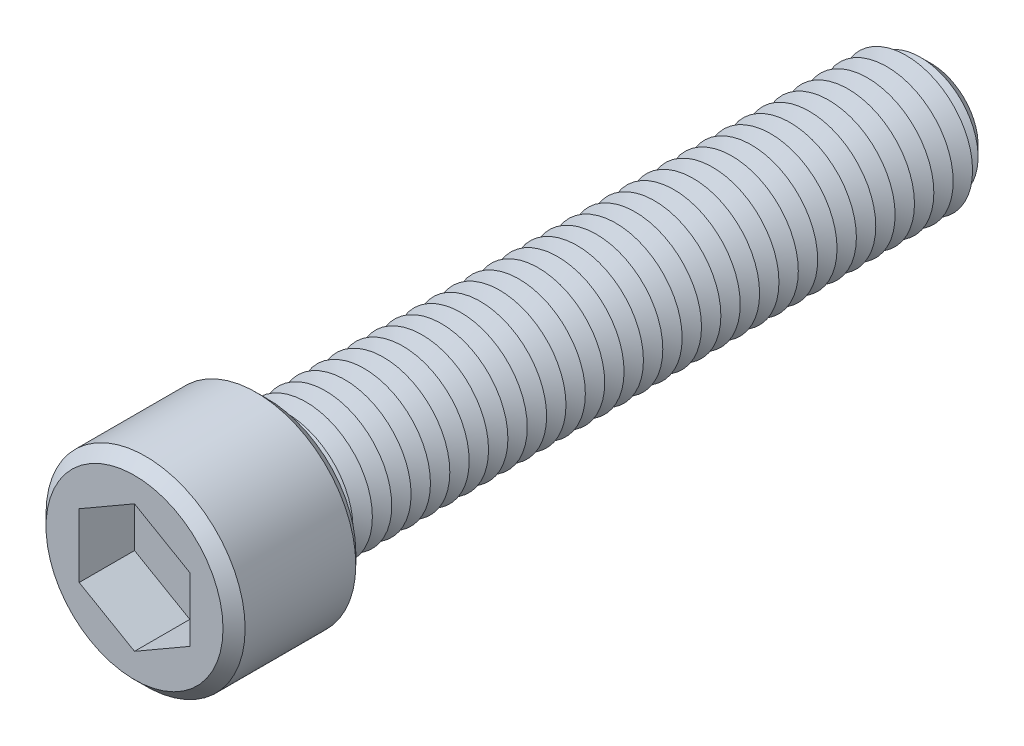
ISO-10303-21;
HEADER;
FILE_DESCRIPTION(('STEP AP214'),'2;1');
FILE_NAME('part.step','',(''),(''),'','','');
FILE_SCHEMA(('AUTOMOTIVE_DESIGN { 1 0 10303 214 1 1 1 1 }'));
ENDSEC;
DATA;
#1=APPLICATION_CONTEXT('core data for automotive mechanical design processes');
#2=APPLICATION_PROTOCOL_DEFINITION('international standard','automotive_design',2000,#1);
#3=PRODUCT_CONTEXT('',#1,'mechanical');
#4=PRODUCT('Part','Part','',(#3));
#5=PRODUCT_RELATED_PRODUCT_CATEGORY('part','',(#4));
#6=PRODUCT_DEFINITION_FORMATION('','',#4);
#7=PRODUCT_DEFINITION_CONTEXT('part definition',#1,'design');
#8=PRODUCT_DEFINITION('design','',#6,#7);
#9=PRODUCT_DEFINITION_SHAPE('','',#8);
#10=(LENGTH_UNIT() NAMED_UNIT(*) SI_UNIT(.MILLI.,.METRE.));
#11=(NAMED_UNIT(*) PLANE_ANGLE_UNIT() SI_UNIT($,.RADIAN.));
#12=(NAMED_UNIT(*) SI_UNIT($,.STERADIAN.) SOLID_ANGLE_UNIT());
#13=UNCERTAINTY_MEASURE_WITH_UNIT(LENGTH_MEASURE(1.E-05),#10,'distance_accuracy_value','');
#14=(GEOMETRIC_REPRESENTATION_CONTEXT(3) GLOBAL_UNCERTAINTY_ASSIGNED_CONTEXT((#13)) GLOBAL_UNIT_ASSIGNED_CONTEXT((#10,
#11,#12)) REPRESENTATION_CONTEXT('',''));
#15=CARTESIAN_POINT('',(0.,0.,0.));
#16=DIRECTION('',(0.,0.,1.));
#17=DIRECTION('',(1.,0.,0.));
#18=AXIS2_PLACEMENT_3D('',#15,#16,#17);
#19=CARTESIAN_POINT('',(0.,0.,12.));
#20=DIRECTION('',(0.,0.,-1.));
#21=DIRECTION('',(-1.,0.,0.));
#22=AXIS2_PLACEMENT_3D('',#19,#20,#21);
#23=CYLINDRICAL_SURFACE('',#22,9.);
#24=CARTESIAN_POINT('',(0.,0.,1.));
#25=DIRECTION('',(0.,0.,1.));
#26=DIRECTION('',(1.,0.,0.));
#27=AXIS2_PLACEMENT_3D('',#24,#25,#26);
#28=CIRCLE('',#27,9.);
#29=CARTESIAN_POINT('',(9.,0.,1.));
#30=VERTEX_POINT('',#29);
#31=EDGE_CURVE('E448',#30,#30,#28,.T.);
#32=ORIENTED_EDGE('',*,*,#31,.T.);
#33=EDGE_LOOP('',(#32));
#34=FACE_BOUND('',#33,.T.);
#35=CARTESIAN_POINT('',(0.,0.,11.));
#36=DIRECTION('',(0.,0.,1.));
#37=DIRECTION('',(1.,0.,0.));
#38=AXIS2_PLACEMENT_3D('',#35,#36,#37);
#39=CIRCLE('',#38,9.);
#40=CARTESIAN_POINT('',(9.,0.,11.));
#41=VERTEX_POINT('',#40);
#42=EDGE_CURVE('E441',#41,#41,#39,.F.);
#43=ORIENTED_EDGE('',*,*,#42,.T.);
#44=EDGE_LOOP('',(#43));
#45=FACE_BOUND('',#44,.T.);
#46=ADVANCED_FACE('F39',(#34,#45),#23,.T.);
#47=CARTESIAN_POINT('',(0.,0.,12.));
#48=DIRECTION('',(0.,0.,1.));
#49=DIRECTION('',(1.,0.,0.));
#50=AXIS2_PLACEMENT_3D('',#47,#48,#49);
#51=PLANE('',#50);
#52=CARTESIAN_POINT('',(0.,0.,12.));
#53=DIRECTION('',(0.,0.,1.));
#54=DIRECTION('',(1.,0.,0.));
#55=AXIS2_PLACEMENT_3D('',#52,#53,#54);
#56=CIRCLE('',#55,7.99999999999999);
#57=CARTESIAN_POINT('',(7.99999999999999,0.,12.));
#58=VERTEX_POINT('',#57);
#59=EDGE_CURVE('E11',#58,#58,#56,.T.);
#60=ORIENTED_EDGE('',*,*,#59,.T.);
#61=EDGE_LOOP('',(#60));
#62=FACE_BOUND('',#61,.T.);
#63=DIRECTION('',(-0.866025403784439,0.5,0.));
#64=VECTOR('',#63,1.);
#65=CARTESIAN_POINT('',(5.,2.88675134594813,12.));
#66=LINE('',#65,#64);
#67=CARTESIAN_POINT('',(5.,2.88675134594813,12.));
#68=VERTEX_POINT('',#67);
#69=CARTESIAN_POINT('',(0.,5.77350269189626,12.));
#70=VERTEX_POINT('',#69);
#71=EDGE_CURVE('E55',#68,#70,#66,.T.);
#72=ORIENTED_EDGE('',*,*,#71,.F.);
#73=DIRECTION('',(0.,1.,0.));
#74=VECTOR('',#73,1.);
#75=CARTESIAN_POINT('',(5.,-2.88675134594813,12.));
#76=LINE('',#75,#74);
#77=CARTESIAN_POINT('',(5.,-2.88675134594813,12.));
#78=VERTEX_POINT('',#77);
#79=EDGE_CURVE('E151',#78,#68,#76,.T.);
#80=ORIENTED_EDGE('',*,*,#79,.F.);
#81=DIRECTION('',(0.866025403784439,0.5,0.));
#82=VECTOR('',#81,1.);
#83=CARTESIAN_POINT('',(0.,-5.77350269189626,12.));
#84=LINE('',#83,#82);
#85=CARTESIAN_POINT('',(0.,-5.77350269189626,12.));
#86=VERTEX_POINT('',#85);
#87=EDGE_CURVE('E148',#86,#78,#84,.T.);
#88=ORIENTED_EDGE('',*,*,#87,.F.);
#89=DIRECTION('',(0.866025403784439,-0.5,0.));
#90=VECTOR('',#89,1.);
#91=CARTESIAN_POINT('',(-5.,-2.88675134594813,12.));
#92=LINE('',#91,#90);
#93=CARTESIAN_POINT('',(-5.,-2.88675134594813,12.));
#94=VERTEX_POINT('',#93);
#95=EDGE_CURVE('E103',#94,#86,#92,.T.);
#96=ORIENTED_EDGE('',*,*,#95,.F.);
#97=DIRECTION('',(0.,-1.,0.));
#98=VECTOR('',#97,1.);
#99=CARTESIAN_POINT('',(-5.,2.88675134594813,12.));
#100=LINE('',#99,#98);
#101=CARTESIAN_POINT('',(-5.,2.88675134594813,12.));
#102=VERTEX_POINT('',#101);
#103=EDGE_CURVE('E142',#102,#94,#100,.T.);
#104=ORIENTED_EDGE('',*,*,#103,.F.);
#105=DIRECTION('',(-0.866025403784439,-0.5,0.));
#106=VECTOR('',#105,1.);
#107=CARTESIAN_POINT('',(0.,5.77350269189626,12.));
#108=LINE('',#107,#106);
#109=EDGE_CURVE('E137',#70,#102,#108,.T.);
#110=ORIENTED_EDGE('',*,*,#109,.F.);
#111=EDGE_LOOP('',(#72,#80,#88,#96,#104,#110));
#112=FACE_BOUND('',#111,.T.);
#113=ADVANCED_FACE('F467',(#62,#112),#51,.T.);
#114=CARTESIAN_POINT('',(0.,0.,0.));
#115=DIRECTION('',(0.,0.,1.));
#116=DIRECTION('',(1.,0.,0.));
#117=AXIS2_PLACEMENT_3D('',#114,#115,#116);
#118=PLANE('',#117);
#119=CARTESIAN_POINT('',(0.,0.,0.));
#120=DIRECTION('',(0.,0.,1.));
#121=DIRECTION('',(1.,0.,0.));
#122=AXIS2_PLACEMENT_3D('',#119,#120,#121);
#123=CIRCLE('',#122,7.99999999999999);
#124=CARTESIAN_POINT('',(7.99999999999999,0.,0.));
#125=VERTEX_POINT('',#124);
#126=EDGE_CURVE('E48',#125,#125,#123,.F.);
#127=ORIENTED_EDGE('',*,*,#126,.T.);
#128=EDGE_LOOP('',(#127));
#129=FACE_BOUND('',#128,.T.);
#130=CARTESIAN_POINT('',(0.,0.,0.));
#131=DIRECTION('',(0.,0.,1.));
#132=DIRECTION('',(1.,0.,0.));
#133=AXIS2_PLACEMENT_3D('',#130,#131,#132);
#134=CIRCLE('',#133,6.);
#135=CARTESIAN_POINT('',(6.,0.,0.));
#136=VERTEX_POINT('',#135);
#137=EDGE_CURVE('E433',#136,#136,#134,.T.);
#138=ORIENTED_EDGE('',*,*,#137,.T.);
#139=EDGE_LOOP('',(#138));
#140=FACE_BOUND('',#139,.T.);
#141=ADVANCED_FACE('F456',(#129,#140),#118,.F.);
#142=CARTESIAN_POINT('',(0.,0.,0.));
#143=DIRECTION('',(0.,0.,1.));
#144=DIRECTION('',(1.,0.,0.));
#145=AXIS2_PLACEMENT_3D('',#142,#143,#144);
#146=CONICAL_SURFACE('',#145,6.,1.0471975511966);
#147=CARTESIAN_POINT('',(0.,0.,-0.875));
#148=DIRECTION('',(0.,0.,1.));
#149=DIRECTION('',(1.,0.,0.));
#150=AXIS2_PLACEMENT_3D('',#147,#148,#149);
#151=CIRCLE('',#150,4.48445554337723);
#152=CARTESIAN_POINT('',(4.48445554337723,0.,-0.875));
#153=VERTEX_POINT('',#152);
#154=EDGE_CURVE('E429',#153,#153,#151,.T.);
#155=ORIENTED_EDGE('',*,*,#154,.T.);
#156=EDGE_LOOP('',(#155));
#157=FACE_BOUND('',#156,.T.);
#158=ORIENTED_EDGE('',*,*,#137,.F.);
#159=EDGE_LOOP('',(#158));
#160=FACE_BOUND('',#159,.T.);
#161=ADVANCED_FACE('F788',(#157,#160),#146,.T.);
#162=CARTESIAN_POINT('',(0.,0.,-0.875));
#163=DIRECTION('',(0.,0.,-1.));
#164=DIRECTION('',(-1.,0.,0.));
#165=AXIS2_PLACEMENT_3D('',#162,#163,#164);
#166=CONICAL_SURFACE('',#165,4.48445554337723,1.0471975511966);
#167=CARTESIAN_POINT('',(0.,0.,-1.75));
#168=DIRECTION('',(0.,0.,1.));
#169=DIRECTION('',(1.,0.,0.));
#170=AXIS2_PLACEMENT_3D('',#167,#168,#169);
#171=CIRCLE('',#170,6.);
#172=CARTESIAN_POINT('',(6.,0.,-1.75));
#173=VERTEX_POINT('',#172);
#174=EDGE_CURVE('E425',#173,#173,#171,.T.);
#175=ORIENTED_EDGE('',*,*,#174,.T.);
#176=EDGE_LOOP('',(#175));
#177=FACE_BOUND('',#176,.T.);
#178=ORIENTED_EDGE('',*,*,#154,.F.);
#179=EDGE_LOOP('',(#178));
#180=FACE_BOUND('',#179,.T.);
#181=ADVANCED_FACE('F784',(#177,#180),#166,.T.);
#182=CARTESIAN_POINT('',(0.,0.,-1.75));
#183=DIRECTION('',(0.,0.,1.));
#184=DIRECTION('',(1.,0.,0.));
#185=AXIS2_PLACEMENT_3D('',#182,#183,#184);
#186=CONICAL_SURFACE('',#185,6.,1.0471975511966);
#187=CARTESIAN_POINT('',(0.,0.,-2.625));
#188=DIRECTION('',(0.,0.,1.));
#189=DIRECTION('',(1.,0.,0.));
#190=AXIS2_PLACEMENT_3D('',#187,#188,#189);
#191=CIRCLE('',#190,4.48445554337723);
#192=CARTESIAN_POINT('',(4.48445554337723,0.,-2.625));
#193=VERTEX_POINT('',#192);
#194=EDGE_CURVE('E421',#193,#193,#191,.T.);
#195=ORIENTED_EDGE('',*,*,#194,.T.);
#196=EDGE_LOOP('',(#195));
#197=FACE_BOUND('',#196,.T.);
#198=ORIENTED_EDGE('',*,*,#174,.F.);
#199=EDGE_LOOP('',(#198));
#200=FACE_BOUND('',#199,.T.);
#201=ADVANCED_FACE('F780',(#197,#200),#186,.T.);
#202=CARTESIAN_POINT('',(0.,0.,-2.625));
#203=DIRECTION('',(0.,0.,-1.));
#204=DIRECTION('',(-1.,0.,0.));
#205=AXIS2_PLACEMENT_3D('',#202,#203,#204);
#206=CONICAL_SURFACE('',#205,4.48445554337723,1.0471975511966);
#207=CARTESIAN_POINT('',(0.,0.,-3.5));
#208=DIRECTION('',(0.,0.,1.));
#209=DIRECTION('',(1.,0.,0.));
#210=AXIS2_PLACEMENT_3D('',#207,#208,#209);
#211=CIRCLE('',#210,6.);
#212=CARTESIAN_POINT('',(6.,0.,-3.5));
#213=VERTEX_POINT('',#212);
#214=EDGE_CURVE('E417',#213,#213,#211,.T.);
#215=ORIENTED_EDGE('',*,*,#214,.T.);
#216=EDGE_LOOP('',(#215));
#217=FACE_BOUND('',#216,.T.);
#218=ORIENTED_EDGE('',*,*,#194,.F.);
#219=EDGE_LOOP('',(#218));
#220=FACE_BOUND('',#219,.T.);
#221=ADVANCED_FACE('F776',(#217,#220),#206,.T.);
#222=CARTESIAN_POINT('',(0.,0.,-3.5));
#223=DIRECTION('',(0.,0.,1.));
#224=DIRECTION('',(1.,0.,0.));
#225=AXIS2_PLACEMENT_3D('',#222,#223,#224);
#226=CONICAL_SURFACE('',#225,6.,1.0471975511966);
#227=CARTESIAN_POINT('',(0.,0.,-4.375));
#228=DIRECTION('',(0.,0.,1.));
#229=DIRECTION('',(1.,0.,0.));
#230=AXIS2_PLACEMENT_3D('',#227,#228,#229);
#231=CIRCLE('',#230,4.48445554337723);
#232=CARTESIAN_POINT('',(4.48445554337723,0.,-4.375));
#233=VERTEX_POINT('',#232);
#234=EDGE_CURVE('E414',#233,#233,#231,.T.);
#235=ORIENTED_EDGE('',*,*,#234,.T.);
#236=EDGE_LOOP('',(#235));
#237=FACE_BOUND('',#236,.T.);
#238=ORIENTED_EDGE('',*,*,#214,.F.);
#239=EDGE_LOOP('',(#238));
#240=FACE_BOUND('',#239,.T.);
#241=ADVANCED_FACE('F772',(#237,#240),#226,.T.);
#242=CARTESIAN_POINT('',(0.,0.,-4.375));
#243=DIRECTION('',(0.,0.,-1.));
#244=DIRECTION('',(-1.,0.,0.));
#245=AXIS2_PLACEMENT_3D('',#242,#243,#244);
#246=CONICAL_SURFACE('',#245,4.48445554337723,1.0471975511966);
#247=CARTESIAN_POINT('',(0.,0.,-5.25));
#248=DIRECTION('',(0.,0.,1.));
#249=DIRECTION('',(1.,0.,0.));
#250=AXIS2_PLACEMENT_3D('',#247,#248,#249);
#251=CIRCLE('',#250,6.);
#252=CARTESIAN_POINT('',(6.,0.,-5.25));
#253=VERTEX_POINT('',#252);
#254=EDGE_CURVE('E411',#253,#253,#251,.T.);
#255=ORIENTED_EDGE('',*,*,#254,.T.);
#256=EDGE_LOOP('',(#255));
#257=FACE_BOUND('',#256,.T.);
#258=ORIENTED_EDGE('',*,*,#234,.F.);
#259=EDGE_LOOP('',(#258));
#260=FACE_BOUND('',#259,.T.);
#261=ADVANCED_FACE('F768',(#257,#260),#246,.T.);
#262=CARTESIAN_POINT('',(0.,0.,-5.25));
#263=DIRECTION('',(0.,0.,1.));
#264=DIRECTION('',(1.,0.,0.));
#265=AXIS2_PLACEMENT_3D('',#262,#263,#264);
#266=CONICAL_SURFACE('',#265,6.,1.0471975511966);
#267=CARTESIAN_POINT('',(0.,0.,-6.125));
#268=DIRECTION('',(0.,0.,1.));
#269=DIRECTION('',(1.,0.,0.));
#270=AXIS2_PLACEMENT_3D('',#267,#268,#269);
#271=CIRCLE('',#270,4.48445554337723);
#272=CARTESIAN_POINT('',(4.48445554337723,0.,-6.125));
#273=VERTEX_POINT('',#272);
#274=EDGE_CURVE('E407',#273,#273,#271,.T.);
#275=ORIENTED_EDGE('',*,*,#274,.T.);
#276=EDGE_LOOP('',(#275));
#277=FACE_BOUND('',#276,.T.);
#278=ORIENTED_EDGE('',*,*,#254,.F.);
#279=EDGE_LOOP('',(#278));
#280=FACE_BOUND('',#279,.T.);
#281=ADVANCED_FACE('F764',(#277,#280),#266,.T.);
#282=CARTESIAN_POINT('',(0.,0.,-6.125));
#283=DIRECTION('',(0.,0.,-1.));
#284=DIRECTION('',(-1.,0.,0.));
#285=AXIS2_PLACEMENT_3D('',#282,#283,#284);
#286=CONICAL_SURFACE('',#285,4.48445554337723,1.0471975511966);
#287=CARTESIAN_POINT('',(0.,0.,-7.));
#288=DIRECTION('',(0.,0.,1.));
#289=DIRECTION('',(1.,0.,0.));
#290=AXIS2_PLACEMENT_3D('',#287,#288,#289);
#291=CIRCLE('',#290,6.);
#292=CARTESIAN_POINT('',(6.,0.,-7.));
#293=VERTEX_POINT('',#292);
#294=EDGE_CURVE('E403',#293,#293,#291,.T.);
#295=ORIENTED_EDGE('',*,*,#294,.T.);
#296=EDGE_LOOP('',(#295));
#297=FACE_BOUND('',#296,.T.);
#298=ORIENTED_EDGE('',*,*,#274,.F.);
#299=EDGE_LOOP('',(#298));
#300=FACE_BOUND('',#299,.T.);
#301=ADVANCED_FACE('F760',(#297,#300),#286,.T.);
#302=CARTESIAN_POINT('',(0.,0.,-7.));
#303=DIRECTION('',(0.,0.,1.));
#304=DIRECTION('',(1.,0.,0.));
#305=AXIS2_PLACEMENT_3D('',#302,#303,#304);
#306=CONICAL_SURFACE('',#305,6.,1.0471975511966);
#307=CARTESIAN_POINT('',(0.,0.,-7.875));
#308=DIRECTION('',(0.,0.,1.));
#309=DIRECTION('',(1.,0.,0.));
#310=AXIS2_PLACEMENT_3D('',#307,#308,#309);
#311=CIRCLE('',#310,4.48445554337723);
#312=CARTESIAN_POINT('',(4.48445554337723,0.,-7.875));
#313=VERTEX_POINT('',#312);
#314=EDGE_CURVE('E399',#313,#313,#311,.T.);
#315=ORIENTED_EDGE('',*,*,#314,.T.);
#316=EDGE_LOOP('',(#315));
#317=FACE_BOUND('',#316,.T.);
#318=ORIENTED_EDGE('',*,*,#294,.F.);
#319=EDGE_LOOP('',(#318));
#320=FACE_BOUND('',#319,.T.);
#321=ADVANCED_FACE('F756',(#317,#320),#306,.T.);
#322=CARTESIAN_POINT('',(0.,0.,-7.875));
#323=DIRECTION('',(0.,0.,-1.));
#324=DIRECTION('',(-1.,0.,0.));
#325=AXIS2_PLACEMENT_3D('',#322,#323,#324);
#326=CONICAL_SURFACE('',#325,4.48445554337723,1.0471975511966);
#327=CARTESIAN_POINT('',(0.,0.,-8.75));
#328=DIRECTION('',(0.,0.,1.));
#329=DIRECTION('',(1.,0.,0.));
#330=AXIS2_PLACEMENT_3D('',#327,#328,#329);
#331=CIRCLE('',#330,6.);
#332=CARTESIAN_POINT('',(6.,0.,-8.75));
#333=VERTEX_POINT('',#332);
#334=EDGE_CURVE('E395',#333,#333,#331,.T.);
#335=ORIENTED_EDGE('',*,*,#334,.T.);
#336=EDGE_LOOP('',(#335));
#337=FACE_BOUND('',#336,.T.);
#338=ORIENTED_EDGE('',*,*,#314,.F.);
#339=EDGE_LOOP('',(#338));
#340=FACE_BOUND('',#339,.T.);
#341=ADVANCED_FACE('F752',(#337,#340),#326,.T.);
#342=CARTESIAN_POINT('',(0.,0.,-8.75));
#343=DIRECTION('',(0.,0.,1.));
#344=DIRECTION('',(1.,0.,0.));
#345=AXIS2_PLACEMENT_3D('',#342,#343,#344);
#346=CONICAL_SURFACE('',#345,6.,1.0471975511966);
#347=CARTESIAN_POINT('',(0.,0.,-9.625));
#348=DIRECTION('',(0.,0.,1.));
#349=DIRECTION('',(1.,0.,0.));
#350=AXIS2_PLACEMENT_3D('',#347,#348,#349);
#351=CIRCLE('',#350,4.48445554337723);
#352=CARTESIAN_POINT('',(4.48445554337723,0.,-9.625));
#353=VERTEX_POINT('',#352);
#354=EDGE_CURVE('E391',#353,#353,#351,.T.);
#355=ORIENTED_EDGE('',*,*,#354,.T.);
#356=EDGE_LOOP('',(#355));
#357=FACE_BOUND('',#356,.T.);
#358=ORIENTED_EDGE('',*,*,#334,.F.);
#359=EDGE_LOOP('',(#358));
#360=FACE_BOUND('',#359,.T.);
#361=ADVANCED_FACE('F748',(#357,#360),#346,.T.);
#362=CARTESIAN_POINT('',(0.,0.,-9.625));
#363=DIRECTION('',(0.,0.,-1.));
#364=DIRECTION('',(-1.,0.,0.));
#365=AXIS2_PLACEMENT_3D('',#362,#363,#364);
#366=CONICAL_SURFACE('',#365,4.48445554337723,1.0471975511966);
#367=CARTESIAN_POINT('',(0.,0.,-10.5));
#368=DIRECTION('',(0.,0.,1.));
#369=DIRECTION('',(1.,0.,0.));
#370=AXIS2_PLACEMENT_3D('',#367,#368,#369);
#371=CIRCLE('',#370,6.);
#372=CARTESIAN_POINT('',(6.,0.,-10.5));
#373=VERTEX_POINT('',#372);
#374=EDGE_CURVE('E387',#373,#373,#371,.T.);
#375=ORIENTED_EDGE('',*,*,#374,.T.);
#376=EDGE_LOOP('',(#375));
#377=FACE_BOUND('',#376,.T.);
#378=ORIENTED_EDGE('',*,*,#354,.F.);
#379=EDGE_LOOP('',(#378));
#380=FACE_BOUND('',#379,.T.);
#381=ADVANCED_FACE('F744',(#377,#380),#366,.T.);
#382=CARTESIAN_POINT('',(0.,0.,-10.5));
#383=DIRECTION('',(0.,0.,1.));
#384=DIRECTION('',(1.,0.,0.));
#385=AXIS2_PLACEMENT_3D('',#382,#383,#384);
#386=CONICAL_SURFACE('',#385,6.,1.0471975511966);
#387=CARTESIAN_POINT('',(0.,0.,-11.375));
#388=DIRECTION('',(0.,0.,1.));
#389=DIRECTION('',(1.,0.,0.));
#390=AXIS2_PLACEMENT_3D('',#387,#388,#389);
#391=CIRCLE('',#390,4.48445554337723);
#392=CARTESIAN_POINT('',(4.48445554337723,0.,-11.375));
#393=VERTEX_POINT('',#392);
#394=EDGE_CURVE('E383',#393,#393,#391,.T.);
#395=ORIENTED_EDGE('',*,*,#394,.T.);
#396=EDGE_LOOP('',(#395));
#397=FACE_BOUND('',#396,.T.);
#398=ORIENTED_EDGE('',*,*,#374,.F.);
#399=EDGE_LOOP('',(#398));
#400=FACE_BOUND('',#399,.T.);
#401=ADVANCED_FACE('F740',(#397,#400),#386,.T.);
#402=CARTESIAN_POINT('',(0.,0.,-11.375));
#403=DIRECTION('',(0.,0.,-1.));
#404=DIRECTION('',(-1.,0.,0.));
#405=AXIS2_PLACEMENT_3D('',#402,#403,#404);
#406=CONICAL_SURFACE('',#405,4.48445554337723,1.0471975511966);
#407=CARTESIAN_POINT('',(0.,0.,-12.25));
#408=DIRECTION('',(0.,0.,1.));
#409=DIRECTION('',(1.,0.,0.));
#410=AXIS2_PLACEMENT_3D('',#407,#408,#409);
#411=CIRCLE('',#410,6.);
#412=CARTESIAN_POINT('',(6.,0.,-12.25));
#413=VERTEX_POINT('',#412);
#414=EDGE_CURVE('E379',#413,#413,#411,.T.);
#415=ORIENTED_EDGE('',*,*,#414,.T.);
#416=EDGE_LOOP('',(#415));
#417=FACE_BOUND('',#416,.T.);
#418=ORIENTED_EDGE('',*,*,#394,.F.);
#419=EDGE_LOOP('',(#418));
#420=FACE_BOUND('',#419,.T.);
#421=ADVANCED_FACE('F736',(#417,#420),#406,.T.);
#422=CARTESIAN_POINT('',(0.,0.,-12.25));
#423=DIRECTION('',(0.,0.,1.));
#424=DIRECTION('',(1.,0.,0.));
#425=AXIS2_PLACEMENT_3D('',#422,#423,#424);
#426=CONICAL_SURFACE('',#425,6.,1.0471975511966);
#427=CARTESIAN_POINT('',(0.,0.,-13.125));
#428=DIRECTION('',(0.,0.,1.));
#429=DIRECTION('',(1.,0.,0.));
#430=AXIS2_PLACEMENT_3D('',#427,#428,#429);
#431=CIRCLE('',#430,4.48445554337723);
#432=CARTESIAN_POINT('',(4.48445554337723,0.,-13.125));
#433=VERTEX_POINT('',#432);
#434=EDGE_CURVE('E375',#433,#433,#431,.T.);
#435=ORIENTED_EDGE('',*,*,#434,.T.);
#436=EDGE_LOOP('',(#435));
#437=FACE_BOUND('',#436,.T.);
#438=ORIENTED_EDGE('',*,*,#414,.F.);
#439=EDGE_LOOP('',(#438));
#440=FACE_BOUND('',#439,.T.);
#441=ADVANCED_FACE('F732',(#437,#440),#426,.T.);
#442=CARTESIAN_POINT('',(0.,0.,-13.125));
#443=DIRECTION('',(0.,0.,-1.));
#444=DIRECTION('',(-1.,0.,0.));
#445=AXIS2_PLACEMENT_3D('',#442,#443,#444);
#446=CONICAL_SURFACE('',#445,4.48445554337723,1.0471975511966);
#447=CARTESIAN_POINT('',(0.,0.,-14.));
#448=DIRECTION('',(0.,0.,1.));
#449=DIRECTION('',(1.,0.,0.));
#450=AXIS2_PLACEMENT_3D('',#447,#448,#449);
#451=CIRCLE('',#450,6.);
#452=CARTESIAN_POINT('',(6.,0.,-14.));
#453=VERTEX_POINT('',#452);
#454=EDGE_CURVE('E371',#453,#453,#451,.T.);
#455=ORIENTED_EDGE('',*,*,#454,.T.);
#456=EDGE_LOOP('',(#455));
#457=FACE_BOUND('',#456,.T.);
#458=ORIENTED_EDGE('',*,*,#434,.F.);
#459=EDGE_LOOP('',(#458));
#460=FACE_BOUND('',#459,.T.);
#461=ADVANCED_FACE('F728',(#457,#460),#446,.T.);
#462=CARTESIAN_POINT('',(0.,0.,-14.));
#463=DIRECTION('',(0.,0.,1.));
#464=DIRECTION('',(1.,0.,0.));
#465=AXIS2_PLACEMENT_3D('',#462,#463,#464);
#466=CONICAL_SURFACE('',#465,6.,1.0471975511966);
#467=CARTESIAN_POINT('',(0.,0.,-14.875));
#468=DIRECTION('',(0.,0.,1.));
#469=DIRECTION('',(1.,0.,0.));
#470=AXIS2_PLACEMENT_3D('',#467,#468,#469);
#471=CIRCLE('',#470,4.48445554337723);
#472=CARTESIAN_POINT('',(4.48445554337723,0.,-14.875));
#473=VERTEX_POINT('',#472);
#474=EDGE_CURVE('E367',#473,#473,#471,.T.);
#475=ORIENTED_EDGE('',*,*,#474,.T.);
#476=EDGE_LOOP('',(#475));
#477=FACE_BOUND('',#476,.T.);
#478=ORIENTED_EDGE('',*,*,#454,.F.);
#479=EDGE_LOOP('',(#478));
#480=FACE_BOUND('',#479,.T.);
#481=ADVANCED_FACE('F724',(#477,#480),#466,.T.);
#482=CARTESIAN_POINT('',(0.,0.,-14.875));
#483=DIRECTION('',(0.,0.,-1.));
#484=DIRECTION('',(-1.,0.,0.));
#485=AXIS2_PLACEMENT_3D('',#482,#483,#484);
#486=CONICAL_SURFACE('',#485,4.48445554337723,1.0471975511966);
#487=CARTESIAN_POINT('',(0.,0.,-15.75));
#488=DIRECTION('',(0.,0.,1.));
#489=DIRECTION('',(1.,0.,0.));
#490=AXIS2_PLACEMENT_3D('',#487,#488,#489);
#491=CIRCLE('',#490,6.);
#492=CARTESIAN_POINT('',(6.,0.,-15.75));
#493=VERTEX_POINT('',#492);
#494=EDGE_CURVE('E363',#493,#493,#491,.T.);
#495=ORIENTED_EDGE('',*,*,#494,.T.);
#496=EDGE_LOOP('',(#495));
#497=FACE_BOUND('',#496,.T.);
#498=ORIENTED_EDGE('',*,*,#474,.F.);
#499=EDGE_LOOP('',(#498));
#500=FACE_BOUND('',#499,.T.);
#501=ADVANCED_FACE('F720',(#497,#500),#486,.T.);
#502=CARTESIAN_POINT('',(0.,0.,-15.75));
#503=DIRECTION('',(0.,0.,1.));
#504=DIRECTION('',(1.,0.,0.));
#505=AXIS2_PLACEMENT_3D('',#502,#503,#504);
#506=CONICAL_SURFACE('',#505,6.,1.0471975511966);
#507=CARTESIAN_POINT('',(0.,0.,-16.625));
#508=DIRECTION('',(0.,0.,1.));
#509=DIRECTION('',(1.,0.,0.));
#510=AXIS2_PLACEMENT_3D('',#507,#508,#509);
#511=CIRCLE('',#510,4.48445554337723);
#512=CARTESIAN_POINT('',(4.48445554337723,0.,-16.625));
#513=VERTEX_POINT('',#512);
#514=EDGE_CURVE('E359',#513,#513,#511,.T.);
#515=ORIENTED_EDGE('',*,*,#514,.T.);
#516=EDGE_LOOP('',(#515));
#517=FACE_BOUND('',#516,.T.);
#518=ORIENTED_EDGE('',*,*,#494,.F.);
#519=EDGE_LOOP('',(#518));
#520=FACE_BOUND('',#519,.T.);
#521=ADVANCED_FACE('F716',(#517,#520),#506,.T.);
#522=CARTESIAN_POINT('',(0.,0.,-16.625));
#523=DIRECTION('',(0.,0.,-1.));
#524=DIRECTION('',(-1.,0.,0.));
#525=AXIS2_PLACEMENT_3D('',#522,#523,#524);
#526=CONICAL_SURFACE('',#525,4.48445554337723,1.0471975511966);
#527=CARTESIAN_POINT('',(0.,0.,-17.5));
#528=DIRECTION('',(0.,0.,1.));
#529=DIRECTION('',(1.,0.,0.));
#530=AXIS2_PLACEMENT_3D('',#527,#528,#529);
#531=CIRCLE('',#530,6.);
#532=CARTESIAN_POINT('',(6.,0.,-17.5));
#533=VERTEX_POINT('',#532);
#534=EDGE_CURVE('E355',#533,#533,#531,.T.);
#535=ORIENTED_EDGE('',*,*,#534,.T.);
#536=EDGE_LOOP('',(#535));
#537=FACE_BOUND('',#536,.T.);
#538=ORIENTED_EDGE('',*,*,#514,.F.);
#539=EDGE_LOOP('',(#538));
#540=FACE_BOUND('',#539,.T.);
#541=ADVANCED_FACE('F712',(#537,#540),#526,.T.);
#542=CARTESIAN_POINT('',(0.,0.,-17.5));
#543=DIRECTION('',(0.,0.,1.));
#544=DIRECTION('',(1.,0.,0.));
#545=AXIS2_PLACEMENT_3D('',#542,#543,#544);
#546=CONICAL_SURFACE('',#545,6.,1.0471975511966);
#547=CARTESIAN_POINT('',(0.,0.,-18.375));
#548=DIRECTION('',(0.,0.,1.));
#549=DIRECTION('',(1.,0.,0.));
#550=AXIS2_PLACEMENT_3D('',#547,#548,#549);
#551=CIRCLE('',#550,4.48445554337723);
#552=CARTESIAN_POINT('',(4.48445554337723,0.,-18.375));
#553=VERTEX_POINT('',#552);
#554=EDGE_CURVE('E351',#553,#553,#551,.T.);
#555=ORIENTED_EDGE('',*,*,#554,.T.);
#556=EDGE_LOOP('',(#555));
#557=FACE_BOUND('',#556,.T.);
#558=ORIENTED_EDGE('',*,*,#534,.F.);
#559=EDGE_LOOP('',(#558));
#560=FACE_BOUND('',#559,.T.);
#561=ADVANCED_FACE('F708',(#557,#560),#546,.T.);
#562=CARTESIAN_POINT('',(0.,0.,-18.375));
#563=DIRECTION('',(0.,0.,-1.));
#564=DIRECTION('',(-1.,0.,0.));
#565=AXIS2_PLACEMENT_3D('',#562,#563,#564);
#566=CONICAL_SURFACE('',#565,4.48445554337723,1.0471975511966);
#567=CARTESIAN_POINT('',(0.,0.,-19.25));
#568=DIRECTION('',(0.,0.,1.));
#569=DIRECTION('',(1.,0.,0.));
#570=AXIS2_PLACEMENT_3D('',#567,#568,#569);
#571=CIRCLE('',#570,6.);
#572=CARTESIAN_POINT('',(6.,0.,-19.25));
#573=VERTEX_POINT('',#572);
#574=EDGE_CURVE('E347',#573,#573,#571,.T.);
#575=ORIENTED_EDGE('',*,*,#574,.T.);
#576=EDGE_LOOP('',(#575));
#577=FACE_BOUND('',#576,.T.);
#578=ORIENTED_EDGE('',*,*,#554,.F.);
#579=EDGE_LOOP('',(#578));
#580=FACE_BOUND('',#579,.T.);
#581=ADVANCED_FACE('F704',(#577,#580),#566,.T.);
#582=CARTESIAN_POINT('',(0.,0.,-19.25));
#583=DIRECTION('',(0.,0.,1.));
#584=DIRECTION('',(1.,0.,0.));
#585=AXIS2_PLACEMENT_3D('',#582,#583,#584);
#586=CONICAL_SURFACE('',#585,6.,1.0471975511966);
#587=CARTESIAN_POINT('',(0.,0.,-20.125));
#588=DIRECTION('',(0.,0.,1.));
#589=DIRECTION('',(1.,0.,0.));
#590=AXIS2_PLACEMENT_3D('',#587,#588,#589);
#591=CIRCLE('',#590,4.48445554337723);
#592=CARTESIAN_POINT('',(4.48445554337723,0.,-20.125));
#593=VERTEX_POINT('',#592);
#594=EDGE_CURVE('E343',#593,#593,#591,.T.);
#595=ORIENTED_EDGE('',*,*,#594,.T.);
#596=EDGE_LOOP('',(#595));
#597=FACE_BOUND('',#596,.T.);
#598=ORIENTED_EDGE('',*,*,#574,.F.);
#599=EDGE_LOOP('',(#598));
#600=FACE_BOUND('',#599,.T.);
#601=ADVANCED_FACE('F700',(#597,#600),#586,.T.);
#602=CARTESIAN_POINT('',(0.,0.,-20.125));
#603=DIRECTION('',(0.,0.,-1.));
#604=DIRECTION('',(-1.,0.,0.));
#605=AXIS2_PLACEMENT_3D('',#602,#603,#604);
#606=CONICAL_SURFACE('',#605,4.48445554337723,1.0471975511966);
#607=CARTESIAN_POINT('',(0.,0.,-21.));
#608=DIRECTION('',(0.,0.,1.));
#609=DIRECTION('',(1.,0.,0.));
#610=AXIS2_PLACEMENT_3D('',#607,#608,#609);
#611=CIRCLE('',#610,6.);
#612=CARTESIAN_POINT('',(6.,0.,-21.));
#613=VERTEX_POINT('',#612);
#614=EDGE_CURVE('E339',#613,#613,#611,.T.);
#615=ORIENTED_EDGE('',*,*,#614,.T.);
#616=EDGE_LOOP('',(#615));
#617=FACE_BOUND('',#616,.T.);
#618=ORIENTED_EDGE('',*,*,#594,.F.);
#619=EDGE_LOOP('',(#618));
#620=FACE_BOUND('',#619,.T.);
#621=ADVANCED_FACE('F696',(#617,#620),#606,.T.);
#622=CARTESIAN_POINT('',(0.,0.,-21.));
#623=DIRECTION('',(0.,0.,1.));
#624=DIRECTION('',(1.,0.,0.));
#625=AXIS2_PLACEMENT_3D('',#622,#623,#624);
#626=CONICAL_SURFACE('',#625,6.,1.0471975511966);
#627=CARTESIAN_POINT('',(0.,0.,-21.875));
#628=DIRECTION('',(0.,0.,1.));
#629=DIRECTION('',(1.,0.,0.));
#630=AXIS2_PLACEMENT_3D('',#627,#628,#629);
#631=CIRCLE('',#630,4.48445554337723);
#632=CARTESIAN_POINT('',(4.48445554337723,0.,-21.875));
#633=VERTEX_POINT('',#632);
#634=EDGE_CURVE('E335',#633,#633,#631,.T.);
#635=ORIENTED_EDGE('',*,*,#634,.T.);
#636=EDGE_LOOP('',(#635));
#637=FACE_BOUND('',#636,.T.);
#638=ORIENTED_EDGE('',*,*,#614,.F.);
#639=EDGE_LOOP('',(#638));
#640=FACE_BOUND('',#639,.T.);
#641=ADVANCED_FACE('F692',(#637,#640),#626,.T.);
#642=CARTESIAN_POINT('',(0.,0.,-21.875));
#643=DIRECTION('',(0.,0.,-1.));
#644=DIRECTION('',(-1.,0.,0.));
#645=AXIS2_PLACEMENT_3D('',#642,#643,#644);
#646=CONICAL_SURFACE('',#645,4.48445554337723,1.0471975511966);
#647=CARTESIAN_POINT('',(0.,0.,-22.75));
#648=DIRECTION('',(0.,0.,1.));
#649=DIRECTION('',(1.,0.,0.));
#650=AXIS2_PLACEMENT_3D('',#647,#648,#649);
#651=CIRCLE('',#650,6.);
#652=CARTESIAN_POINT('',(6.,0.,-22.75));
#653=VERTEX_POINT('',#652);
#654=EDGE_CURVE('E331',#653,#653,#651,.T.);
#655=ORIENTED_EDGE('',*,*,#654,.T.);
#656=EDGE_LOOP('',(#655));
#657=FACE_BOUND('',#656,.T.);
#658=ORIENTED_EDGE('',*,*,#634,.F.);
#659=EDGE_LOOP('',(#658));
#660=FACE_BOUND('',#659,.T.);
#661=ADVANCED_FACE('F688',(#657,#660),#646,.T.);
#662=CARTESIAN_POINT('',(0.,0.,-22.75));
#663=DIRECTION('',(0.,0.,1.));
#664=DIRECTION('',(1.,0.,0.));
#665=AXIS2_PLACEMENT_3D('',#662,#663,#664);
#666=CONICAL_SURFACE('',#665,6.,1.0471975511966);
#667=CARTESIAN_POINT('',(0.,0.,-23.625));
#668=DIRECTION('',(0.,0.,1.));
#669=DIRECTION('',(1.,0.,0.));
#670=AXIS2_PLACEMENT_3D('',#667,#668,#669);
#671=CIRCLE('',#670,4.48445554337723);
#672=CARTESIAN_POINT('',(4.48445554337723,0.,-23.625));
#673=VERTEX_POINT('',#672);
#674=EDGE_CURVE('E327',#673,#673,#671,.T.);
#675=ORIENTED_EDGE('',*,*,#674,.T.);
#676=EDGE_LOOP('',(#675));
#677=FACE_BOUND('',#676,.T.);
#678=ORIENTED_EDGE('',*,*,#654,.F.);
#679=EDGE_LOOP('',(#678));
#680=FACE_BOUND('',#679,.T.);
#681=ADVANCED_FACE('F684',(#677,#680),#666,.T.);
#682=CARTESIAN_POINT('',(0.,0.,-23.625));
#683=DIRECTION('',(0.,0.,-1.));
#684=DIRECTION('',(-1.,0.,0.));
#685=AXIS2_PLACEMENT_3D('',#682,#683,#684);
#686=CONICAL_SURFACE('',#685,4.48445554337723,1.0471975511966);
#687=CARTESIAN_POINT('',(0.,0.,-24.5));
#688=DIRECTION('',(0.,0.,1.));
#689=DIRECTION('',(1.,0.,0.));
#690=AXIS2_PLACEMENT_3D('',#687,#688,#689);
#691=CIRCLE('',#690,6.);
#692=CARTESIAN_POINT('',(6.,0.,-24.5));
#693=VERTEX_POINT('',#692);
#694=EDGE_CURVE('E323',#693,#693,#691,.T.);
#695=ORIENTED_EDGE('',*,*,#694,.T.);
#696=EDGE_LOOP('',(#695));
#697=FACE_BOUND('',#696,.T.);
#698=ORIENTED_EDGE('',*,*,#674,.F.);
#699=EDGE_LOOP('',(#698));
#700=FACE_BOUND('',#699,.T.);
#701=ADVANCED_FACE('F680',(#697,#700),#686,.T.);
#702=CARTESIAN_POINT('',(0.,0.,-24.5));
#703=DIRECTION('',(0.,0.,1.));
#704=DIRECTION('',(1.,0.,0.));
#705=AXIS2_PLACEMENT_3D('',#702,#703,#704);
#706=CONICAL_SURFACE('',#705,6.,1.0471975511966);
#707=CARTESIAN_POINT('',(0.,0.,-25.375));
#708=DIRECTION('',(0.,0.,1.));
#709=DIRECTION('',(1.,0.,0.));
#710=AXIS2_PLACEMENT_3D('',#707,#708,#709);
#711=CIRCLE('',#710,4.48445554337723);
#712=CARTESIAN_POINT('',(4.48445554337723,0.,-25.375));
#713=VERTEX_POINT('',#712);
#714=EDGE_CURVE('E319',#713,#713,#711,.T.);
#715=ORIENTED_EDGE('',*,*,#714,.T.);
#716=EDGE_LOOP('',(#715));
#717=FACE_BOUND('',#716,.T.);
#718=ORIENTED_EDGE('',*,*,#694,.F.);
#719=EDGE_LOOP('',(#718));
#720=FACE_BOUND('',#719,.T.);
#721=ADVANCED_FACE('F676',(#717,#720),#706,.T.);
#722=CARTESIAN_POINT('',(0.,0.,-25.375));
#723=DIRECTION('',(0.,0.,-1.));
#724=DIRECTION('',(-1.,0.,0.));
#725=AXIS2_PLACEMENT_3D('',#722,#723,#724);
#726=CONICAL_SURFACE('',#725,4.48445554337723,1.0471975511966);
#727=CARTESIAN_POINT('',(0.,0.,-26.25));
#728=DIRECTION('',(0.,0.,1.));
#729=DIRECTION('',(1.,0.,0.));
#730=AXIS2_PLACEMENT_3D('',#727,#728,#729);
#731=CIRCLE('',#730,6.);
#732=CARTESIAN_POINT('',(6.,0.,-26.25));
#733=VERTEX_POINT('',#732);
#734=EDGE_CURVE('E315',#733,#733,#731,.T.);
#735=ORIENTED_EDGE('',*,*,#734,.T.);
#736=EDGE_LOOP('',(#735));
#737=FACE_BOUND('',#736,.T.);
#738=ORIENTED_EDGE('',*,*,#714,.F.);
#739=EDGE_LOOP('',(#738));
#740=FACE_BOUND('',#739,.T.);
#741=ADVANCED_FACE('F672',(#737,#740),#726,.T.);
#742=CARTESIAN_POINT('',(0.,0.,-26.25));
#743=DIRECTION('',(0.,0.,1.));
#744=DIRECTION('',(1.,0.,0.));
#745=AXIS2_PLACEMENT_3D('',#742,#743,#744);
#746=CONICAL_SURFACE('',#745,6.,1.0471975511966);
#747=CARTESIAN_POINT('',(0.,0.,-27.125));
#748=DIRECTION('',(0.,0.,1.));
#749=DIRECTION('',(1.,0.,0.));
#750=AXIS2_PLACEMENT_3D('',#747,#748,#749);
#751=CIRCLE('',#750,4.48445554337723);
#752=CARTESIAN_POINT('',(4.48445554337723,0.,-27.125));
#753=VERTEX_POINT('',#752);
#754=EDGE_CURVE('E311',#753,#753,#751,.T.);
#755=ORIENTED_EDGE('',*,*,#754,.T.);
#756=EDGE_LOOP('',(#755));
#757=FACE_BOUND('',#756,.T.);
#758=ORIENTED_EDGE('',*,*,#734,.F.);
#759=EDGE_LOOP('',(#758));
#760=FACE_BOUND('',#759,.T.);
#761=ADVANCED_FACE('F668',(#757,#760),#746,.T.);
#762=CARTESIAN_POINT('',(0.,0.,-27.125));
#763=DIRECTION('',(0.,0.,-1.));
#764=DIRECTION('',(-1.,0.,0.));
#765=AXIS2_PLACEMENT_3D('',#762,#763,#764);
#766=CONICAL_SURFACE('',#765,4.48445554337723,1.0471975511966);
#767=CARTESIAN_POINT('',(0.,0.,-28.));
#768=DIRECTION('',(0.,0.,1.));
#769=DIRECTION('',(1.,0.,0.));
#770=AXIS2_PLACEMENT_3D('',#767,#768,#769);
#771=CIRCLE('',#770,6.);
#772=CARTESIAN_POINT('',(6.,0.,-28.));
#773=VERTEX_POINT('',#772);
#774=EDGE_CURVE('E307',#773,#773,#771,.T.);
#775=ORIENTED_EDGE('',*,*,#774,.T.);
#776=EDGE_LOOP('',(#775));
#777=FACE_BOUND('',#776,.T.);
#778=ORIENTED_EDGE('',*,*,#754,.F.);
#779=EDGE_LOOP('',(#778));
#780=FACE_BOUND('',#779,.T.);
#781=ADVANCED_FACE('F664',(#777,#780),#766,.T.);
#782=CARTESIAN_POINT('',(0.,0.,-28.));
#783=DIRECTION('',(0.,0.,1.));
#784=DIRECTION('',(1.,0.,0.));
#785=AXIS2_PLACEMENT_3D('',#782,#783,#784);
#786=CONICAL_SURFACE('',#785,6.,1.0471975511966);
#787=CARTESIAN_POINT('',(0.,0.,-28.875));
#788=DIRECTION('',(0.,0.,1.));
#789=DIRECTION('',(1.,0.,0.));
#790=AXIS2_PLACEMENT_3D('',#787,#788,#789);
#791=CIRCLE('',#790,4.48445554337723);
#792=CARTESIAN_POINT('',(4.48445554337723,0.,-28.875));
#793=VERTEX_POINT('',#792);
#794=EDGE_CURVE('E303',#793,#793,#791,.T.);
#795=ORIENTED_EDGE('',*,*,#794,.T.);
#796=EDGE_LOOP('',(#795));
#797=FACE_BOUND('',#796,.T.);
#798=ORIENTED_EDGE('',*,*,#774,.F.);
#799=EDGE_LOOP('',(#798));
#800=FACE_BOUND('',#799,.T.);
#801=ADVANCED_FACE('F660',(#797,#800),#786,.T.);
#802=CARTESIAN_POINT('',(0.,0.,-28.875));
#803=DIRECTION('',(0.,0.,-1.));
#804=DIRECTION('',(-1.,0.,0.));
#805=AXIS2_PLACEMENT_3D('',#802,#803,#804);
#806=CONICAL_SURFACE('',#805,4.48445554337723,1.0471975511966);
#807=CARTESIAN_POINT('',(0.,0.,-29.75));
#808=DIRECTION('',(0.,0.,1.));
#809=DIRECTION('',(1.,0.,0.));
#810=AXIS2_PLACEMENT_3D('',#807,#808,#809);
#811=CIRCLE('',#810,6.);
#812=CARTESIAN_POINT('',(6.,0.,-29.75));
#813=VERTEX_POINT('',#812);
#814=EDGE_CURVE('E299',#813,#813,#811,.T.);
#815=ORIENTED_EDGE('',*,*,#814,.T.);
#816=EDGE_LOOP('',(#815));
#817=FACE_BOUND('',#816,.T.);
#818=ORIENTED_EDGE('',*,*,#794,.F.);
#819=EDGE_LOOP('',(#818));
#820=FACE_BOUND('',#819,.T.);
#821=ADVANCED_FACE('F656',(#817,#820),#806,.T.);
#822=CARTESIAN_POINT('',(0.,0.,-29.75));
#823=DIRECTION('',(0.,0.,1.));
#824=DIRECTION('',(1.,0.,0.));
#825=AXIS2_PLACEMENT_3D('',#822,#823,#824);
#826=CONICAL_SURFACE('',#825,6.,1.0471975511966);
#827=CARTESIAN_POINT('',(0.,0.,-30.625));
#828=DIRECTION('',(0.,0.,1.));
#829=DIRECTION('',(1.,0.,0.));
#830=AXIS2_PLACEMENT_3D('',#827,#828,#829);
#831=CIRCLE('',#830,4.48445554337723);
#832=CARTESIAN_POINT('',(4.48445554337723,0.,-30.625));
#833=VERTEX_POINT('',#832);
#834=EDGE_CURVE('E295',#833,#833,#831,.T.);
#835=ORIENTED_EDGE('',*,*,#834,.T.);
#836=EDGE_LOOP('',(#835));
#837=FACE_BOUND('',#836,.T.);
#838=ORIENTED_EDGE('',*,*,#814,.F.);
#839=EDGE_LOOP('',(#838));
#840=FACE_BOUND('',#839,.T.);
#841=ADVANCED_FACE('F652',(#837,#840),#826,.T.);
#842=CARTESIAN_POINT('',(0.,0.,-30.625));
#843=DIRECTION('',(0.,0.,-1.));
#844=DIRECTION('',(-1.,0.,0.));
#845=AXIS2_PLACEMENT_3D('',#842,#843,#844);
#846=CONICAL_SURFACE('',#845,4.48445554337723,1.0471975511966);
#847=CARTESIAN_POINT('',(0.,0.,-31.5));
#848=DIRECTION('',(0.,0.,1.));
#849=DIRECTION('',(1.,0.,0.));
#850=AXIS2_PLACEMENT_3D('',#847,#848,#849);
#851=CIRCLE('',#850,6.);
#852=CARTESIAN_POINT('',(6.,0.,-31.5));
#853=VERTEX_POINT('',#852);
#854=EDGE_CURVE('E291',#853,#853,#851,.T.);
#855=ORIENTED_EDGE('',*,*,#854,.T.);
#856=EDGE_LOOP('',(#855));
#857=FACE_BOUND('',#856,.T.);
#858=ORIENTED_EDGE('',*,*,#834,.F.);
#859=EDGE_LOOP('',(#858));
#860=FACE_BOUND('',#859,.T.);
#861=ADVANCED_FACE('F648',(#857,#860),#846,.T.);
#862=CARTESIAN_POINT('',(0.,0.,-31.5));
#863=DIRECTION('',(0.,0.,1.));
#864=DIRECTION('',(1.,0.,0.));
#865=AXIS2_PLACEMENT_3D('',#862,#863,#864);
#866=CONICAL_SURFACE('',#865,6.,1.0471975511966);
#867=CARTESIAN_POINT('',(0.,0.,-32.375));
#868=DIRECTION('',(0.,0.,1.));
#869=DIRECTION('',(1.,0.,0.));
#870=AXIS2_PLACEMENT_3D('',#867,#868,#869);
#871=CIRCLE('',#870,4.48445554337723);
#872=CARTESIAN_POINT('',(4.48445554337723,0.,-32.375));
#873=VERTEX_POINT('',#872);
#874=EDGE_CURVE('E287',#873,#873,#871,.T.);
#875=ORIENTED_EDGE('',*,*,#874,.T.);
#876=EDGE_LOOP('',(#875));
#877=FACE_BOUND('',#876,.T.);
#878=ORIENTED_EDGE('',*,*,#854,.F.);
#879=EDGE_LOOP('',(#878));
#880=FACE_BOUND('',#879,.T.);
#881=ADVANCED_FACE('F644',(#877,#880),#866,.T.);
#882=CARTESIAN_POINT('',(0.,0.,-32.375));
#883=DIRECTION('',(0.,0.,-1.));
#884=DIRECTION('',(-1.,0.,0.));
#885=AXIS2_PLACEMENT_3D('',#882,#883,#884);
#886=CONICAL_SURFACE('',#885,4.48445554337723,1.0471975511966);
#887=CARTESIAN_POINT('',(0.,0.,-33.25));
#888=DIRECTION('',(0.,0.,1.));
#889=DIRECTION('',(1.,0.,0.));
#890=AXIS2_PLACEMENT_3D('',#887,#888,#889);
#891=CIRCLE('',#890,6.);
#892=CARTESIAN_POINT('',(6.,0.,-33.25));
#893=VERTEX_POINT('',#892);
#894=EDGE_CURVE('E283',#893,#893,#891,.T.);
#895=ORIENTED_EDGE('',*,*,#894,.T.);
#896=EDGE_LOOP('',(#895));
#897=FACE_BOUND('',#896,.T.);
#898=ORIENTED_EDGE('',*,*,#874,.F.);
#899=EDGE_LOOP('',(#898));
#900=FACE_BOUND('',#899,.T.);
#901=ADVANCED_FACE('F640',(#897,#900),#886,.T.);
#902=CARTESIAN_POINT('',(0.,0.,-33.25));
#903=DIRECTION('',(0.,0.,1.));
#904=DIRECTION('',(1.,0.,0.));
#905=AXIS2_PLACEMENT_3D('',#902,#903,#904);
#906=CONICAL_SURFACE('',#905,6.,1.0471975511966);
#907=CARTESIAN_POINT('',(0.,0.,-34.125));
#908=DIRECTION('',(0.,0.,1.));
#909=DIRECTION('',(1.,0.,0.));
#910=AXIS2_PLACEMENT_3D('',#907,#908,#909);
#911=CIRCLE('',#910,4.48445554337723);
#912=CARTESIAN_POINT('',(4.48445554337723,0.,-34.125));
#913=VERTEX_POINT('',#912);
#914=EDGE_CURVE('E279',#913,#913,#911,.T.);
#915=ORIENTED_EDGE('',*,*,#914,.T.);
#916=EDGE_LOOP('',(#915));
#917=FACE_BOUND('',#916,.T.);
#918=ORIENTED_EDGE('',*,*,#894,.F.);
#919=EDGE_LOOP('',(#918));
#920=FACE_BOUND('',#919,.T.);
#921=ADVANCED_FACE('F636',(#917,#920),#906,.T.);
#922=CARTESIAN_POINT('',(0.,0.,-34.125));
#923=DIRECTION('',(0.,0.,-1.));
#924=DIRECTION('',(-1.,0.,0.));
#925=AXIS2_PLACEMENT_3D('',#922,#923,#924);
#926=CONICAL_SURFACE('',#925,4.48445554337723,1.0471975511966);
#927=CARTESIAN_POINT('',(0.,0.,-35.));
#928=DIRECTION('',(0.,0.,1.));
#929=DIRECTION('',(1.,0.,0.));
#930=AXIS2_PLACEMENT_3D('',#927,#928,#929);
#931=CIRCLE('',#930,6.);
#932=CARTESIAN_POINT('',(6.,0.,-35.));
#933=VERTEX_POINT('',#932);
#934=EDGE_CURVE('E275',#933,#933,#931,.T.);
#935=ORIENTED_EDGE('',*,*,#934,.T.);
#936=EDGE_LOOP('',(#935));
#937=FACE_BOUND('',#936,.T.);
#938=ORIENTED_EDGE('',*,*,#914,.F.);
#939=EDGE_LOOP('',(#938));
#940=FACE_BOUND('',#939,.T.);
#941=ADVANCED_FACE('F632',(#937,#940),#926,.T.);
#942=CARTESIAN_POINT('',(0.,0.,-35.));
#943=DIRECTION('',(0.,0.,1.));
#944=DIRECTION('',(1.,0.,0.));
#945=AXIS2_PLACEMENT_3D('',#942,#943,#944);
#946=CONICAL_SURFACE('',#945,6.,1.0471975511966);
#947=CARTESIAN_POINT('',(0.,0.,-35.875));
#948=DIRECTION('',(0.,0.,1.));
#949=DIRECTION('',(1.,0.,0.));
#950=AXIS2_PLACEMENT_3D('',#947,#948,#949);
#951=CIRCLE('',#950,4.48445554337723);
#952=CARTESIAN_POINT('',(4.48445554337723,0.,-35.875));
#953=VERTEX_POINT('',#952);
#954=EDGE_CURVE('E271',#953,#953,#951,.T.);
#955=ORIENTED_EDGE('',*,*,#954,.T.);
#956=EDGE_LOOP('',(#955));
#957=FACE_BOUND('',#956,.T.);
#958=ORIENTED_EDGE('',*,*,#934,.F.);
#959=EDGE_LOOP('',(#958));
#960=FACE_BOUND('',#959,.T.);
#961=ADVANCED_FACE('F628',(#957,#960),#946,.T.);
#962=CARTESIAN_POINT('',(0.,0.,-35.875));
#963=DIRECTION('',(0.,0.,-1.));
#964=DIRECTION('',(-1.,0.,0.));
#965=AXIS2_PLACEMENT_3D('',#962,#963,#964);
#966=CONICAL_SURFACE('',#965,4.48445554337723,1.0471975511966);
#967=CARTESIAN_POINT('',(0.,0.,-36.75));
#968=DIRECTION('',(0.,0.,1.));
#969=DIRECTION('',(1.,0.,0.));
#970=AXIS2_PLACEMENT_3D('',#967,#968,#969);
#971=CIRCLE('',#970,6.);
#972=CARTESIAN_POINT('',(6.,0.,-36.75));
#973=VERTEX_POINT('',#972);
#974=EDGE_CURVE('E267',#973,#973,#971,.T.);
#975=ORIENTED_EDGE('',*,*,#974,.T.);
#976=EDGE_LOOP('',(#975));
#977=FACE_BOUND('',#976,.T.);
#978=ORIENTED_EDGE('',*,*,#954,.F.);
#979=EDGE_LOOP('',(#978));
#980=FACE_BOUND('',#979,.T.);
#981=ADVANCED_FACE('F624',(#977,#980),#966,.T.);
#982=CARTESIAN_POINT('',(0.,0.,-36.75));
#983=DIRECTION('',(0.,0.,1.));
#984=DIRECTION('',(1.,0.,0.));
#985=AXIS2_PLACEMENT_3D('',#982,#983,#984);
#986=CONICAL_SURFACE('',#985,6.,1.0471975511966);
#987=CARTESIAN_POINT('',(0.,0.,-37.625));
#988=DIRECTION('',(0.,0.,1.));
#989=DIRECTION('',(1.,0.,0.));
#990=AXIS2_PLACEMENT_3D('',#987,#988,#989);
#991=CIRCLE('',#990,4.48445554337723);
#992=CARTESIAN_POINT('',(4.48445554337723,0.,-37.625));
#993=VERTEX_POINT('',#992);
#994=EDGE_CURVE('E263',#993,#993,#991,.T.);
#995=ORIENTED_EDGE('',*,*,#994,.T.);
#996=EDGE_LOOP('',(#995));
#997=FACE_BOUND('',#996,.T.);
#998=ORIENTED_EDGE('',*,*,#974,.F.);
#999=EDGE_LOOP('',(#998));
#1000=FACE_BOUND('',#999,.T.);
#1001=ADVANCED_FACE('F620',(#997,#1000),#986,.T.);
#1002=CARTESIAN_POINT('',(0.,0.,-37.625));
#1003=DIRECTION('',(0.,0.,-1.));
#1004=DIRECTION('',(-1.,0.,0.));
#1005=AXIS2_PLACEMENT_3D('',#1002,#1003,#1004);
#1006=CONICAL_SURFACE('',#1005,4.48445554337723,1.0471975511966);
#1007=CARTESIAN_POINT('',(0.,0.,-38.5));
#1008=DIRECTION('',(0.,0.,1.));
#1009=DIRECTION('',(1.,0.,0.));
#1010=AXIS2_PLACEMENT_3D('',#1007,#1008,#1009);
#1011=CIRCLE('',#1010,6.);
#1012=CARTESIAN_POINT('',(6.,0.,-38.5));
#1013=VERTEX_POINT('',#1012);
#1014=EDGE_CURVE('E259',#1013,#1013,#1011,.T.);
#1015=ORIENTED_EDGE('',*,*,#1014,.T.);
#1016=EDGE_LOOP('',(#1015));
#1017=FACE_BOUND('',#1016,.T.);
#1018=ORIENTED_EDGE('',*,*,#994,.F.);
#1019=EDGE_LOOP('',(#1018));
#1020=FACE_BOUND('',#1019,.T.);
#1021=ADVANCED_FACE('F616',(#1017,#1020),#1006,.T.);
#1022=CARTESIAN_POINT('',(0.,0.,-38.5));
#1023=DIRECTION('',(0.,0.,1.));
#1024=DIRECTION('',(1.,0.,0.));
#1025=AXIS2_PLACEMENT_3D('',#1022,#1023,#1024);
#1026=CONICAL_SURFACE('',#1025,6.,1.0471975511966);
#1027=CARTESIAN_POINT('',(0.,0.,-39.375));
#1028=DIRECTION('',(0.,0.,1.));
#1029=DIRECTION('',(1.,0.,0.));
#1030=AXIS2_PLACEMENT_3D('',#1027,#1028,#1029);
#1031=CIRCLE('',#1030,4.48445554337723);
#1032=CARTESIAN_POINT('',(4.48445554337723,0.,-39.375));
#1033=VERTEX_POINT('',#1032);
#1034=EDGE_CURVE('E255',#1033,#1033,#1031,.T.);
#1035=ORIENTED_EDGE('',*,*,#1034,.T.);
#1036=EDGE_LOOP('',(#1035));
#1037=FACE_BOUND('',#1036,.T.);
#1038=ORIENTED_EDGE('',*,*,#1014,.F.);
#1039=EDGE_LOOP('',(#1038));
#1040=FACE_BOUND('',#1039,.T.);
#1041=ADVANCED_FACE('F612',(#1037,#1040),#1026,.T.);
#1042=CARTESIAN_POINT('',(0.,0.,-39.375));
#1043=DIRECTION('',(0.,0.,-1.));
#1044=DIRECTION('',(-1.,0.,0.));
#1045=AXIS2_PLACEMENT_3D('',#1042,#1043,#1044);
#1046=CONICAL_SURFACE('',#1045,4.48445554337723,1.0471975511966);
#1047=CARTESIAN_POINT('',(0.,0.,-40.25));
#1048=DIRECTION('',(0.,0.,1.));
#1049=DIRECTION('',(1.,0.,0.));
#1050=AXIS2_PLACEMENT_3D('',#1047,#1048,#1049);
#1051=CIRCLE('',#1050,6.);
#1052=CARTESIAN_POINT('',(6.,0.,-40.25));
#1053=VERTEX_POINT('',#1052);
#1054=EDGE_CURVE('E251',#1053,#1053,#1051,.T.);
#1055=ORIENTED_EDGE('',*,*,#1054,.T.);
#1056=EDGE_LOOP('',(#1055));
#1057=FACE_BOUND('',#1056,.T.);
#1058=ORIENTED_EDGE('',*,*,#1034,.F.);
#1059=EDGE_LOOP('',(#1058));
#1060=FACE_BOUND('',#1059,.T.);
#1061=ADVANCED_FACE('F608',(#1057,#1060),#1046,.T.);
#1062=CARTESIAN_POINT('',(0.,0.,-40.25));
#1063=DIRECTION('',(0.,0.,1.));
#1064=DIRECTION('',(1.,0.,0.));
#1065=AXIS2_PLACEMENT_3D('',#1062,#1063,#1064);
#1066=CONICAL_SURFACE('',#1065,6.,1.0471975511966);
#1067=CARTESIAN_POINT('',(0.,0.,-41.125));
#1068=DIRECTION('',(0.,0.,1.));
#1069=DIRECTION('',(1.,0.,0.));
#1070=AXIS2_PLACEMENT_3D('',#1067,#1068,#1069);
#1071=CIRCLE('',#1070,4.48445554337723);
#1072=CARTESIAN_POINT('',(4.48445554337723,0.,-41.125));
#1073=VERTEX_POINT('',#1072);
#1074=EDGE_CURVE('E247',#1073,#1073,#1071,.T.);
#1075=ORIENTED_EDGE('',*,*,#1074,.T.);
#1076=EDGE_LOOP('',(#1075));
#1077=FACE_BOUND('',#1076,.T.);
#1078=ORIENTED_EDGE('',*,*,#1054,.F.);
#1079=EDGE_LOOP('',(#1078));
#1080=FACE_BOUND('',#1079,.T.);
#1081=ADVANCED_FACE('F604',(#1077,#1080),#1066,.T.);
#1082=CARTESIAN_POINT('',(0.,0.,-41.125));
#1083=DIRECTION('',(0.,0.,-1.));
#1084=DIRECTION('',(-1.,0.,0.));
#1085=AXIS2_PLACEMENT_3D('',#1082,#1083,#1084);
#1086=CONICAL_SURFACE('',#1085,4.48445554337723,1.0471975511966);
#1087=CARTESIAN_POINT('',(0.,0.,-42.));
#1088=DIRECTION('',(0.,0.,1.));
#1089=DIRECTION('',(1.,0.,0.));
#1090=AXIS2_PLACEMENT_3D('',#1087,#1088,#1089);
#1091=CIRCLE('',#1090,6.);
#1092=CARTESIAN_POINT('',(6.,0.,-42.));
#1093=VERTEX_POINT('',#1092);
#1094=EDGE_CURVE('E243',#1093,#1093,#1091,.T.);
#1095=ORIENTED_EDGE('',*,*,#1094,.T.);
#1096=EDGE_LOOP('',(#1095));
#1097=FACE_BOUND('',#1096,.T.);
#1098=ORIENTED_EDGE('',*,*,#1074,.F.);
#1099=EDGE_LOOP('',(#1098));
#1100=FACE_BOUND('',#1099,.T.);
#1101=ADVANCED_FACE('F600',(#1097,#1100),#1086,.T.);
#1102=CARTESIAN_POINT('',(0.,0.,-42.));
#1103=DIRECTION('',(0.,0.,1.));
#1104=DIRECTION('',(1.,0.,0.));
#1105=AXIS2_PLACEMENT_3D('',#1102,#1103,#1104);
#1106=CONICAL_SURFACE('',#1105,6.,1.0471975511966);
#1107=CARTESIAN_POINT('',(0.,0.,-42.875));
#1108=DIRECTION('',(0.,0.,1.));
#1109=DIRECTION('',(1.,0.,0.));
#1110=AXIS2_PLACEMENT_3D('',#1107,#1108,#1109);
#1111=CIRCLE('',#1110,4.48445554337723);
#1112=CARTESIAN_POINT('',(4.48445554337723,0.,-42.875));
#1113=VERTEX_POINT('',#1112);
#1114=EDGE_CURVE('E239',#1113,#1113,#1111,.T.);
#1115=ORIENTED_EDGE('',*,*,#1114,.T.);
#1116=EDGE_LOOP('',(#1115));
#1117=FACE_BOUND('',#1116,.T.);
#1118=ORIENTED_EDGE('',*,*,#1094,.F.);
#1119=EDGE_LOOP('',(#1118));
#1120=FACE_BOUND('',#1119,.T.);
#1121=ADVANCED_FACE('F596',(#1117,#1120),#1106,.T.);
#1122=CARTESIAN_POINT('',(0.,0.,-42.875));
#1123=DIRECTION('',(0.,0.,-1.));
#1124=DIRECTION('',(-1.,0.,0.));
#1125=AXIS2_PLACEMENT_3D('',#1122,#1123,#1124);
#1126=CONICAL_SURFACE('',#1125,4.48445554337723,1.0471975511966);
#1127=CARTESIAN_POINT('',(0.,0.,-43.75));
#1128=DIRECTION('',(0.,0.,1.));
#1129=DIRECTION('',(1.,0.,0.));
#1130=AXIS2_PLACEMENT_3D('',#1127,#1128,#1129);
#1131=CIRCLE('',#1130,6.);
#1132=CARTESIAN_POINT('',(6.,0.,-43.75));
#1133=VERTEX_POINT('',#1132);
#1134=EDGE_CURVE('E235',#1133,#1133,#1131,.T.);
#1135=ORIENTED_EDGE('',*,*,#1134,.T.);
#1136=EDGE_LOOP('',(#1135));
#1137=FACE_BOUND('',#1136,.T.);
#1138=ORIENTED_EDGE('',*,*,#1114,.F.);
#1139=EDGE_LOOP('',(#1138));
#1140=FACE_BOUND('',#1139,.T.);
#1141=ADVANCED_FACE('F592',(#1137,#1140),#1126,.T.);
#1142=CARTESIAN_POINT('',(0.,0.,-43.75));
#1143=DIRECTION('',(0.,0.,1.));
#1144=DIRECTION('',(1.,0.,0.));
#1145=AXIS2_PLACEMENT_3D('',#1142,#1143,#1144);
#1146=CONICAL_SURFACE('',#1145,6.,1.0471975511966);
#1147=CARTESIAN_POINT('',(0.,0.,-44.625));
#1148=DIRECTION('',(0.,0.,1.));
#1149=DIRECTION('',(1.,0.,0.));
#1150=AXIS2_PLACEMENT_3D('',#1147,#1148,#1149);
#1151=CIRCLE('',#1150,4.48445554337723);
#1152=CARTESIAN_POINT('',(4.48445554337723,0.,-44.625));
#1153=VERTEX_POINT('',#1152);
#1154=EDGE_CURVE('E231',#1153,#1153,#1151,.T.);
#1155=ORIENTED_EDGE('',*,*,#1154,.T.);
#1156=EDGE_LOOP('',(#1155));
#1157=FACE_BOUND('',#1156,.T.);
#1158=ORIENTED_EDGE('',*,*,#1134,.F.);
#1159=EDGE_LOOP('',(#1158));
#1160=FACE_BOUND('',#1159,.T.);
#1161=ADVANCED_FACE('F588',(#1157,#1160),#1146,.T.);
#1162=CARTESIAN_POINT('',(0.,0.,-44.625));
#1163=DIRECTION('',(0.,0.,-1.));
#1164=DIRECTION('',(-1.,0.,0.));
#1165=AXIS2_PLACEMENT_3D('',#1162,#1163,#1164);
#1166=CONICAL_SURFACE('',#1165,4.48445554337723,1.0471975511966);
#1167=CARTESIAN_POINT('',(0.,0.,-45.5));
#1168=DIRECTION('',(0.,0.,1.));
#1169=DIRECTION('',(1.,0.,0.));
#1170=AXIS2_PLACEMENT_3D('',#1167,#1168,#1169);
#1171=CIRCLE('',#1170,6.);
#1172=CARTESIAN_POINT('',(6.,0.,-45.5));
#1173=VERTEX_POINT('',#1172);
#1174=EDGE_CURVE('E227',#1173,#1173,#1171,.T.);
#1175=ORIENTED_EDGE('',*,*,#1174,.T.);
#1176=EDGE_LOOP('',(#1175));
#1177=FACE_BOUND('',#1176,.T.);
#1178=ORIENTED_EDGE('',*,*,#1154,.F.);
#1179=EDGE_LOOP('',(#1178));
#1180=FACE_BOUND('',#1179,.T.);
#1181=ADVANCED_FACE('F584',(#1177,#1180),#1166,.T.);
#1182=CARTESIAN_POINT('',(0.,0.,-45.5));
#1183=DIRECTION('',(0.,0.,1.));
#1184=DIRECTION('',(1.,0.,0.));
#1185=AXIS2_PLACEMENT_3D('',#1182,#1183,#1184);
#1186=CONICAL_SURFACE('',#1185,6.,1.0471975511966);
#1187=CARTESIAN_POINT('',(0.,0.,-46.375));
#1188=DIRECTION('',(0.,0.,1.));
#1189=DIRECTION('',(1.,0.,0.));
#1190=AXIS2_PLACEMENT_3D('',#1187,#1188,#1189);
#1191=CIRCLE('',#1190,4.48445554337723);
#1192=CARTESIAN_POINT('',(4.48445554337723,0.,-46.375));
#1193=VERTEX_POINT('',#1192);
#1194=EDGE_CURVE('E223',#1193,#1193,#1191,.T.);
#1195=ORIENTED_EDGE('',*,*,#1194,.T.);
#1196=EDGE_LOOP('',(#1195));
#1197=FACE_BOUND('',#1196,.T.);
#1198=ORIENTED_EDGE('',*,*,#1174,.F.);
#1199=EDGE_LOOP('',(#1198));
#1200=FACE_BOUND('',#1199,.T.);
#1201=ADVANCED_FACE('F580',(#1197,#1200),#1186,.T.);
#1202=CARTESIAN_POINT('',(0.,0.,-46.375));
#1203=DIRECTION('',(0.,0.,-1.));
#1204=DIRECTION('',(-1.,0.,0.));
#1205=AXIS2_PLACEMENT_3D('',#1202,#1203,#1204);
#1206=CONICAL_SURFACE('',#1205,4.48445554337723,1.0471975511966);
#1207=CARTESIAN_POINT('',(0.,0.,-47.25));
#1208=DIRECTION('',(0.,0.,1.));
#1209=DIRECTION('',(1.,0.,0.));
#1210=AXIS2_PLACEMENT_3D('',#1207,#1208,#1209);
#1211=CIRCLE('',#1210,6.);
#1212=CARTESIAN_POINT('',(6.,0.,-47.25));
#1213=VERTEX_POINT('',#1212);
#1214=EDGE_CURVE('E219',#1213,#1213,#1211,.T.);
#1215=ORIENTED_EDGE('',*,*,#1214,.T.);
#1216=EDGE_LOOP('',(#1215));
#1217=FACE_BOUND('',#1216,.T.);
#1218=ORIENTED_EDGE('',*,*,#1194,.F.);
#1219=EDGE_LOOP('',(#1218));
#1220=FACE_BOUND('',#1219,.T.);
#1221=ADVANCED_FACE('F576',(#1217,#1220),#1206,.T.);
#1222=CARTESIAN_POINT('',(0.,0.,-47.25));
#1223=DIRECTION('',(0.,0.,1.));
#1224=DIRECTION('',(1.,0.,0.));
#1225=AXIS2_PLACEMENT_3D('',#1222,#1223,#1224);
#1226=CONICAL_SURFACE('',#1225,6.,1.0471975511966);
#1227=CARTESIAN_POINT('',(0.,0.,-48.125));
#1228=DIRECTION('',(0.,0.,1.));
#1229=DIRECTION('',(1.,0.,0.));
#1230=AXIS2_PLACEMENT_3D('',#1227,#1228,#1229);
#1231=CIRCLE('',#1230,4.48445554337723);
#1232=CARTESIAN_POINT('',(4.48445554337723,0.,-48.125));
#1233=VERTEX_POINT('',#1232);
#1234=EDGE_CURVE('E215',#1233,#1233,#1231,.T.);
#1235=ORIENTED_EDGE('',*,*,#1234,.T.);
#1236=EDGE_LOOP('',(#1235));
#1237=FACE_BOUND('',#1236,.T.);
#1238=ORIENTED_EDGE('',*,*,#1214,.F.);
#1239=EDGE_LOOP('',(#1238));
#1240=FACE_BOUND('',#1239,.T.);
#1241=ADVANCED_FACE('F572',(#1237,#1240),#1226,.T.);
#1242=CARTESIAN_POINT('',(0.,0.,-48.125));
#1243=DIRECTION('',(0.,0.,-1.));
#1244=DIRECTION('',(-1.,0.,0.));
#1245=AXIS2_PLACEMENT_3D('',#1242,#1243,#1244);
#1246=CONICAL_SURFACE('',#1245,4.48445554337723,1.0471975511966);
#1247=CARTESIAN_POINT('',(0.,0.,-49.));
#1248=DIRECTION('',(0.,0.,1.));
#1249=DIRECTION('',(1.,0.,0.));
#1250=AXIS2_PLACEMENT_3D('',#1247,#1248,#1249);
#1251=CIRCLE('',#1250,6.);
#1252=CARTESIAN_POINT('',(6.,0.,-49.));
#1253=VERTEX_POINT('',#1252);
#1254=EDGE_CURVE('E211',#1253,#1253,#1251,.T.);
#1255=ORIENTED_EDGE('',*,*,#1254,.T.);
#1256=EDGE_LOOP('',(#1255));
#1257=FACE_BOUND('',#1256,.T.);
#1258=ORIENTED_EDGE('',*,*,#1234,.F.);
#1259=EDGE_LOOP('',(#1258));
#1260=FACE_BOUND('',#1259,.T.);
#1261=ADVANCED_FACE('F568',(#1257,#1260),#1246,.T.);
#1262=CARTESIAN_POINT('',(0.,0.,-49.));
#1263=DIRECTION('',(0.,0.,1.));
#1264=DIRECTION('',(1.,0.,0.));
#1265=AXIS2_PLACEMENT_3D('',#1262,#1263,#1264);
#1266=CONICAL_SURFACE('',#1265,6.,1.0471975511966);
#1267=CARTESIAN_POINT('',(0.,0.,-49.875));
#1268=DIRECTION('',(0.,0.,1.));
#1269=DIRECTION('',(1.,0.,0.));
#1270=AXIS2_PLACEMENT_3D('',#1267,#1268,#1269);
#1271=CIRCLE('',#1270,4.48445554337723);
#1272=CARTESIAN_POINT('',(4.48445554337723,0.,-49.875));
#1273=VERTEX_POINT('',#1272);
#1274=EDGE_CURVE('E207',#1273,#1273,#1271,.T.);
#1275=ORIENTED_EDGE('',*,*,#1274,.T.);
#1276=EDGE_LOOP('',(#1275));
#1277=FACE_BOUND('',#1276,.T.);
#1278=ORIENTED_EDGE('',*,*,#1254,.F.);
#1279=EDGE_LOOP('',(#1278));
#1280=FACE_BOUND('',#1279,.T.);
#1281=ADVANCED_FACE('F564',(#1277,#1280),#1266,.T.);
#1282=CARTESIAN_POINT('',(0.,0.,-49.875));
#1283=DIRECTION('',(0.,0.,-1.));
#1284=DIRECTION('',(-1.,0.,0.));
#1285=AXIS2_PLACEMENT_3D('',#1282,#1283,#1284);
#1286=CONICAL_SURFACE('',#1285,4.48445554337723,1.0471975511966);
#1287=CARTESIAN_POINT('',(0.,0.,-50.75));
#1288=DIRECTION('',(0.,0.,1.));
#1289=DIRECTION('',(1.,0.,0.));
#1290=AXIS2_PLACEMENT_3D('',#1287,#1288,#1289);
#1291=CIRCLE('',#1290,6.);
#1292=CARTESIAN_POINT('',(6.,0.,-50.75));
#1293=VERTEX_POINT('',#1292);
#1294=EDGE_CURVE('E203',#1293,#1293,#1291,.T.);
#1295=ORIENTED_EDGE('',*,*,#1294,.T.);
#1296=EDGE_LOOP('',(#1295));
#1297=FACE_BOUND('',#1296,.T.);
#1298=ORIENTED_EDGE('',*,*,#1274,.F.);
#1299=EDGE_LOOP('',(#1298));
#1300=FACE_BOUND('',#1299,.T.);
#1301=ADVANCED_FACE('F560',(#1297,#1300),#1286,.T.);
#1302=CARTESIAN_POINT('',(0.,0.,-50.75));
#1303=DIRECTION('',(0.,0.,1.));
#1304=DIRECTION('',(1.,0.,0.));
#1305=AXIS2_PLACEMENT_3D('',#1302,#1303,#1304);
#1306=CONICAL_SURFACE('',#1305,6.,1.0471975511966);
#1307=CARTESIAN_POINT('',(0.,0.,-51.625));
#1308=DIRECTION('',(0.,0.,1.));
#1309=DIRECTION('',(1.,0.,0.));
#1310=AXIS2_PLACEMENT_3D('',#1307,#1308,#1309);
#1311=CIRCLE('',#1310,4.48445554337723);
#1312=CARTESIAN_POINT('',(4.48445554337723,0.,-51.625));
#1313=VERTEX_POINT('',#1312);
#1314=EDGE_CURVE('E199',#1313,#1313,#1311,.T.);
#1315=ORIENTED_EDGE('',*,*,#1314,.T.);
#1316=EDGE_LOOP('',(#1315));
#1317=FACE_BOUND('',#1316,.T.);
#1318=ORIENTED_EDGE('',*,*,#1294,.F.);
#1319=EDGE_LOOP('',(#1318));
#1320=FACE_BOUND('',#1319,.T.);
#1321=ADVANCED_FACE('F556',(#1317,#1320),#1306,.T.);
#1322=CARTESIAN_POINT('',(0.,0.,-51.625));
#1323=DIRECTION('',(0.,0.,-1.));
#1324=DIRECTION('',(-1.,0.,0.));
#1325=AXIS2_PLACEMENT_3D('',#1322,#1323,#1324);
#1326=CONICAL_SURFACE('',#1325,4.48445554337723,1.0471975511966);
#1327=CARTESIAN_POINT('',(0.,0.,-52.5));
#1328=DIRECTION('',(0.,0.,1.));
#1329=DIRECTION('',(1.,0.,0.));
#1330=AXIS2_PLACEMENT_3D('',#1327,#1328,#1329);
#1331=CIRCLE('',#1330,6.);
#1332=CARTESIAN_POINT('',(6.,0.,-52.5));
#1333=VERTEX_POINT('',#1332);
#1334=EDGE_CURVE('E195',#1333,#1333,#1331,.T.);
#1335=ORIENTED_EDGE('',*,*,#1334,.T.);
#1336=EDGE_LOOP('',(#1335));
#1337=FACE_BOUND('',#1336,.T.);
#1338=ORIENTED_EDGE('',*,*,#1314,.F.);
#1339=EDGE_LOOP('',(#1338));
#1340=FACE_BOUND('',#1339,.T.);
#1341=ADVANCED_FACE('F552',(#1337,#1340),#1326,.T.);
#1342=CARTESIAN_POINT('',(0.,0.,-52.5));
#1343=DIRECTION('',(0.,0.,1.));
#1344=DIRECTION('',(1.,0.,0.));
#1345=AXIS2_PLACEMENT_3D('',#1342,#1343,#1344);
#1346=CONICAL_SURFACE('',#1345,6.,1.0471975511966);
#1347=CARTESIAN_POINT('',(0.,0.,-53.375));
#1348=DIRECTION('',(0.,0.,1.));
#1349=DIRECTION('',(1.,0.,0.));
#1350=AXIS2_PLACEMENT_3D('',#1347,#1348,#1349);
#1351=CIRCLE('',#1350,4.48445554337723);
#1352=CARTESIAN_POINT('',(4.48445554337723,0.,-53.375));
#1353=VERTEX_POINT('',#1352);
#1354=EDGE_CURVE('E191',#1353,#1353,#1351,.T.);
#1355=ORIENTED_EDGE('',*,*,#1354,.T.);
#1356=EDGE_LOOP('',(#1355));
#1357=FACE_BOUND('',#1356,.T.);
#1358=ORIENTED_EDGE('',*,*,#1334,.F.);
#1359=EDGE_LOOP('',(#1358));
#1360=FACE_BOUND('',#1359,.T.);
#1361=ADVANCED_FACE('F548',(#1357,#1360),#1346,.T.);
#1362=CARTESIAN_POINT('',(0.,0.,-53.375));
#1363=DIRECTION('',(0.,0.,-1.));
#1364=DIRECTION('',(-1.,0.,0.));
#1365=AXIS2_PLACEMENT_3D('',#1362,#1363,#1364);
#1366=CONICAL_SURFACE('',#1365,4.48445554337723,1.0471975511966);
#1367=CARTESIAN_POINT('',(0.,0.,-54.25));
#1368=DIRECTION('',(0.,0.,1.));
#1369=DIRECTION('',(1.,0.,0.));
#1370=AXIS2_PLACEMENT_3D('',#1367,#1368,#1369);
#1371=CIRCLE('',#1370,6.);
#1372=CARTESIAN_POINT('',(6.,0.,-54.25));
#1373=VERTEX_POINT('',#1372);
#1374=EDGE_CURVE('E187',#1373,#1373,#1371,.T.);
#1375=ORIENTED_EDGE('',*,*,#1374,.T.);
#1376=EDGE_LOOP('',(#1375));
#1377=FACE_BOUND('',#1376,.T.);
#1378=ORIENTED_EDGE('',*,*,#1354,.F.);
#1379=EDGE_LOOP('',(#1378));
#1380=FACE_BOUND('',#1379,.T.);
#1381=ADVANCED_FACE('F544',(#1377,#1380),#1366,.T.);
#1382=CARTESIAN_POINT('',(0.,0.,-54.25));
#1383=DIRECTION('',(0.,0.,1.));
#1384=DIRECTION('',(1.,0.,0.));
#1385=AXIS2_PLACEMENT_3D('',#1382,#1383,#1384);
#1386=CONICAL_SURFACE('',#1385,6.,1.0471975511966);
#1387=CARTESIAN_POINT('',(0.,0.,-55.125));
#1388=DIRECTION('',(0.,0.,1.));
#1389=DIRECTION('',(1.,0.,0.));
#1390=AXIS2_PLACEMENT_3D('',#1387,#1388,#1389);
#1391=CIRCLE('',#1390,4.48445554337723);
#1392=CARTESIAN_POINT('',(4.48445554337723,0.,-55.125));
#1393=VERTEX_POINT('',#1392);
#1394=EDGE_CURVE('E183',#1393,#1393,#1391,.T.);
#1395=ORIENTED_EDGE('',*,*,#1394,.T.);
#1396=EDGE_LOOP('',(#1395));
#1397=FACE_BOUND('',#1396,.T.);
#1398=ORIENTED_EDGE('',*,*,#1374,.F.);
#1399=EDGE_LOOP('',(#1398));
#1400=FACE_BOUND('',#1399,.T.);
#1401=ADVANCED_FACE('F540',(#1397,#1400),#1386,.T.);
#1402=CARTESIAN_POINT('',(0.,0.,-55.125));
#1403=DIRECTION('',(0.,0.,-1.));
#1404=DIRECTION('',(-1.,0.,0.));
#1405=AXIS2_PLACEMENT_3D('',#1402,#1403,#1404);
#1406=CONICAL_SURFACE('',#1405,4.48445554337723,1.0471975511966);
#1407=CARTESIAN_POINT('',(0.,0.,-56.));
#1408=DIRECTION('',(0.,0.,1.));
#1409=DIRECTION('',(1.,0.,0.));
#1410=AXIS2_PLACEMENT_3D('',#1407,#1408,#1409);
#1411=CIRCLE('',#1410,6.);
#1412=CARTESIAN_POINT('',(6.,0.,-56.));
#1413=VERTEX_POINT('',#1412);
#1414=EDGE_CURVE('E179',#1413,#1413,#1411,.T.);
#1415=ORIENTED_EDGE('',*,*,#1414,.T.);
#1416=EDGE_LOOP('',(#1415));
#1417=FACE_BOUND('',#1416,.T.);
#1418=ORIENTED_EDGE('',*,*,#1394,.F.);
#1419=EDGE_LOOP('',(#1418));
#1420=FACE_BOUND('',#1419,.T.);
#1421=ADVANCED_FACE('F536',(#1417,#1420),#1406,.T.);
#1422=CARTESIAN_POINT('',(0.,0.,-56.));
#1423=DIRECTION('',(0.,0.,1.));
#1424=DIRECTION('',(1.,0.,0.));
#1425=AXIS2_PLACEMENT_3D('',#1422,#1423,#1424);
#1426=CONICAL_SURFACE('',#1425,6.,1.0471975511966);
#1427=CARTESIAN_POINT('',(0.,0.,-56.875));
#1428=DIRECTION('',(0.,0.,1.));
#1429=DIRECTION('',(1.,0.,0.));
#1430=AXIS2_PLACEMENT_3D('',#1427,#1428,#1429);
#1431=CIRCLE('',#1430,4.48445554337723);
#1432=CARTESIAN_POINT('',(4.48445554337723,0.,-56.875));
#1433=VERTEX_POINT('',#1432);
#1434=EDGE_CURVE('E175',#1433,#1433,#1431,.T.);
#1435=ORIENTED_EDGE('',*,*,#1434,.T.);
#1436=EDGE_LOOP('',(#1435));
#1437=FACE_BOUND('',#1436,.T.);
#1438=ORIENTED_EDGE('',*,*,#1414,.F.);
#1439=EDGE_LOOP('',(#1438));
#1440=FACE_BOUND('',#1439,.T.);
#1441=ADVANCED_FACE('F532',(#1437,#1440),#1426,.T.);
#1442=CARTESIAN_POINT('',(0.,0.,-56.875));
#1443=DIRECTION('',(0.,0.,-1.));
#1444=DIRECTION('',(-1.,0.,0.));
#1445=AXIS2_PLACEMENT_3D('',#1442,#1443,#1444);
#1446=CONICAL_SURFACE('',#1445,4.48445554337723,1.0471975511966);
#1447=CARTESIAN_POINT('',(0.,0.,-57.75));
#1448=DIRECTION('',(0.,0.,1.));
#1449=DIRECTION('',(1.,0.,0.));
#1450=AXIS2_PLACEMENT_3D('',#1447,#1448,#1449);
#1451=CIRCLE('',#1450,6.);
#1452=CARTESIAN_POINT('',(6.,0.,-57.75));
#1453=VERTEX_POINT('',#1452);
#1454=EDGE_CURVE('E170',#1453,#1453,#1451,.T.);
#1455=ORIENTED_EDGE('',*,*,#1454,.T.);
#1456=EDGE_LOOP('',(#1455));
#1457=FACE_BOUND('',#1456,.T.);
#1458=ORIENTED_EDGE('',*,*,#1434,.F.);
#1459=EDGE_LOOP('',(#1458));
#1460=FACE_BOUND('',#1459,.T.);
#1461=ADVANCED_FACE('F528',(#1457,#1460),#1446,.T.);
#1462=CARTESIAN_POINT('',(0.,0.,-57.75));
#1463=DIRECTION('',(0.,0.,1.));
#1464=DIRECTION('',(1.,0.,0.));
#1465=AXIS2_PLACEMENT_3D('',#1462,#1463,#1464);
#1466=CONICAL_SURFACE('',#1465,6.,1.0471975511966);
#1467=CARTESIAN_POINT('',(0.,0.,-58.625));
#1468=DIRECTION('',(0.,0.,1.));
#1469=DIRECTION('',(1.,0.,0.));
#1470=AXIS2_PLACEMENT_3D('',#1467,#1468,#1469);
#1471=CIRCLE('',#1470,4.48445554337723);
#1472=CARTESIAN_POINT('',(4.48445554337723,0.,-58.625));
#1473=VERTEX_POINT('',#1472);
#1474=EDGE_CURVE('E157',#1473,#1473,#1471,.T.);
#1475=ORIENTED_EDGE('',*,*,#1474,.T.);
#1476=EDGE_LOOP('',(#1475));
#1477=FACE_BOUND('',#1476,.T.);
#1478=ORIENTED_EDGE('',*,*,#1454,.F.);
#1479=EDGE_LOOP('',(#1478));
#1480=FACE_BOUND('',#1479,.T.);
#1481=ADVANCED_FACE('F524',(#1477,#1480),#1466,.T.);
#1482=CARTESIAN_POINT('',(0.,0.,-58.625));
#1483=DIRECTION('',(0.,0.,-1.));
#1484=DIRECTION('',(-1.,0.,0.));
#1485=AXIS2_PLACEMENT_3D('',#1482,#1483,#1484);
#1486=CONICAL_SURFACE('',#1485,4.48445554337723,1.0471975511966);
#1487=CARTESIAN_POINT('',(0.,0.,-59.0424682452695));
#1488=DIRECTION('',(0.,0.,-1.));
#1489=DIRECTION('',(-1.,0.,0.));
#1490=AXIS2_PLACEMENT_3D('',#1487,#1488,#1489);
#1491=CIRCLE('',#1490,5.20753175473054);
#1492=CARTESIAN_POINT('',(-5.20753175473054,0.,-59.0424682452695));
#1493=VERTEX_POINT('',#1492);
#1494=EDGE_CURVE('E174',#1493,#1493,#1491,.T.);
#1495=ORIENTED_EDGE('',*,*,#1494,.F.);
#1496=EDGE_LOOP('',(#1495));
#1497=FACE_BOUND('',#1496,.T.);
#1498=ORIENTED_EDGE('',*,*,#1474,.F.);
#1499=EDGE_LOOP('',(#1498));
#1500=FACE_BOUND('',#1499,.T.);
#1501=ADVANCED_FACE('F520',(#1497,#1500),#1486,.T.);
#1502=CARTESIAN_POINT('',(0.,0.,-60.));
#1503=DIRECTION('',(0.,0.,-1.));
#1504=DIRECTION('',(-1.,0.,0.));
#1505=AXIS2_PLACEMENT_3D('',#1502,#1503,#1504);
#1506=PLANE('',#1505);
#1507=CARTESIAN_POINT('',(0.,0.,-60.));
#1508=DIRECTION('',(0.,0.,-1.));
#1509=DIRECTION('',(-1.,0.,0.));
#1510=AXIS2_PLACEMENT_3D('',#1507,#1508,#1509);
#1511=CIRCLE('',#1510,0.9);
#1512=CARTESIAN_POINT('',(-0.9,0.,-60.));
#1513=VERTEX_POINT('',#1512);
#1514=EDGE_CURVE('E138',#1513,#1513,#1511,.F.);
#1515=ORIENTED_EDGE('',*,*,#1514,.T.);
#1516=EDGE_LOOP('',(#1515));
#1517=FACE_BOUND('',#1516,.T.);
#1518=CARTESIAN_POINT('',(0.,0.,-60.));
#1519=DIRECTION('',(0.,0.,-1.));
#1520=DIRECTION('',(-1.,0.,0.));
#1521=AXIS2_PLACEMENT_3D('',#1518,#1519,#1520);
#1522=CIRCLE('',#1521,4.25);
#1523=CARTESIAN_POINT('',(-4.25,0.,-60.));
#1524=VERTEX_POINT('',#1523);
#1525=EDGE_CURVE('E437',#1524,#1524,#1522,.T.);
#1526=ORIENTED_EDGE('',*,*,#1525,.T.);
#1527=EDGE_LOOP('',(#1526));
#1528=FACE_BOUND('',#1527,.T.);
#1529=ADVANCED_FACE('F523',(#1517,#1528),#1506,.T.);
#1530=CARTESIAN_POINT('',(0.,0.,-60.));
#1531=DIRECTION('',(0.,0.,1.));
#1532=DIRECTION('',(1.,0.,0.));
#1533=AXIS2_PLACEMENT_3D('',#1530,#1531,#1532);
#1534=CONICAL_SURFACE('',#1533,4.25,0.785398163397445);
#1535=ORIENTED_EDGE('',*,*,#1525,.F.);
#1536=EDGE_LOOP('',(#1535));
#1537=FACE_BOUND('',#1536,.T.);
#1538=ORIENTED_EDGE('',*,*,#1494,.T.);
#1539=EDGE_LOOP('',(#1538));
#1540=FACE_BOUND('',#1539,.T.);
#1541=ADVANCED_FACE('F519',(#1537,#1540),#1534,.T.);
#1542=CARTESIAN_POINT('',(5.,2.88675134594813,7.));
#1543=DIRECTION('',(0.5,0.866025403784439,0.));
#1544=DIRECTION('',(-0.866025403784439,0.5,0.));
#1545=AXIS2_PLACEMENT_3D('',#1542,#1543,#1544);
#1546=PLANE('',#1545);
#1547=ORIENTED_EDGE('',*,*,#71,.T.);
#1548=DIRECTION('',(0.,0.,1.));
#1549=VECTOR('',#1548,1.);
#1550=CARTESIAN_POINT('',(0.,5.77350269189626,7.));
#1551=LINE('',#1550,#1549);
#1552=CARTESIAN_POINT('',(0.,5.77350269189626,7.));
#1553=VERTEX_POINT('',#1552);
#1554=EDGE_CURVE('E85',#1553,#70,#1551,.T.);
#1555=ORIENTED_EDGE('',*,*,#1554,.F.);
#1556=DIRECTION('',(-0.866025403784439,0.5,0.));
#1557=VECTOR('',#1556,1.);
#1558=CARTESIAN_POINT('',(5.,2.88675134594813,7.));
#1559=LINE('',#1558,#1557);
#1560=CARTESIAN_POINT('',(5.,2.88675134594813,7.));
#1561=VERTEX_POINT('',#1560);
#1562=EDGE_CURVE('E154',#1561,#1553,#1559,.T.);
#1563=ORIENTED_EDGE('',*,*,#1562,.F.);
#1564=DIRECTION('',(0.,0.,1.));
#1565=VECTOR('',#1564,1.);
#1566=CARTESIAN_POINT('',(5.,2.88675134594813,7.));
#1567=LINE('',#1566,#1565);
#1568=EDGE_CURVE('E63',#1561,#68,#1567,.T.);
#1569=ORIENTED_EDGE('',*,*,#1568,.T.);
#1570=EDGE_LOOP('',(#1547,#1555,#1563,#1569));
#1571=FACE_BOUND('',#1570,.T.);
#1572=ADVANCED_FACE('F509',(#1571),#1546,.F.);
#1573=CARTESIAN_POINT('',(5.,-2.88675134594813,7.));
#1574=DIRECTION('',(1.,0.,0.));
#1575=DIRECTION('',(0.,0.,-1.));
#1576=AXIS2_PLACEMENT_3D('',#1573,#1574,#1575);
#1577=PLANE('',#1576);
#1578=ORIENTED_EDGE('',*,*,#79,.T.);
#1579=ORIENTED_EDGE('',*,*,#1568,.F.);
#1580=DIRECTION('',(0.,1.,0.));
#1581=VECTOR('',#1580,1.);
#1582=CARTESIAN_POINT('',(5.,-2.88675134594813,7.));
#1583=LINE('',#1582,#1581);
#1584=CARTESIAN_POINT('',(5.,-2.88675134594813,7.));
#1585=VERTEX_POINT('',#1584);
#1586=EDGE_CURVE('E117',#1585,#1561,#1583,.T.);
#1587=ORIENTED_EDGE('',*,*,#1586,.F.);
#1588=DIRECTION('',(0.,0.,1.));
#1589=VECTOR('',#1588,1.);
#1590=CARTESIAN_POINT('',(5.,-2.88675134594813,7.));
#1591=LINE('',#1590,#1589);
#1592=EDGE_CURVE('E108',#1585,#78,#1591,.T.);
#1593=ORIENTED_EDGE('',*,*,#1592,.T.);
#1594=EDGE_LOOP('',(#1578,#1579,#1587,#1593));
#1595=FACE_BOUND('',#1594,.T.);
#1596=ADVANCED_FACE('F506',(#1595),#1577,.F.);
#1597=CARTESIAN_POINT('',(0.,-5.77350269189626,7.));
#1598=DIRECTION('',(0.5,-0.866025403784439,0.));
#1599=DIRECTION('',(0.866025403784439,0.5,0.));
#1600=AXIS2_PLACEMENT_3D('',#1597,#1598,#1599);
#1601=PLANE('',#1600);
#1602=ORIENTED_EDGE('',*,*,#87,.T.);
#1603=ORIENTED_EDGE('',*,*,#1592,.F.);
#1604=DIRECTION('',(0.866025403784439,0.5,0.));
#1605=VECTOR('',#1604,1.);
#1606=CARTESIAN_POINT('',(0.,-5.77350269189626,7.));
#1607=LINE('',#1606,#1605);
#1608=CARTESIAN_POINT('',(0.,-5.77350269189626,7.));
#1609=VERTEX_POINT('',#1608);
#1610=EDGE_CURVE('E112',#1609,#1585,#1607,.T.);
#1611=ORIENTED_EDGE('',*,*,#1610,.F.);
#1612=DIRECTION('',(0.,0.,1.));
#1613=VECTOR('',#1612,1.);
#1614=CARTESIAN_POINT('',(0.,-5.77350269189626,7.));
#1615=LINE('',#1614,#1613);
#1616=EDGE_CURVE('E96',#1609,#86,#1615,.T.);
#1617=ORIENTED_EDGE('',*,*,#1616,.T.);
#1618=EDGE_LOOP('',(#1602,#1603,#1611,#1617));
#1619=FACE_BOUND('',#1618,.T.);
#1620=ADVANCED_FACE('F113',(#1619),#1601,.F.);
#1621=CARTESIAN_POINT('',(-5.,-2.88675134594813,7.));
#1622=DIRECTION('',(-0.5,-0.866025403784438,0.));
#1623=DIRECTION('',(0.866025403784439,-0.5,0.));
#1624=AXIS2_PLACEMENT_3D('',#1621,#1622,#1623);
#1625=PLANE('',#1624);
#1626=ORIENTED_EDGE('',*,*,#95,.T.);
#1627=ORIENTED_EDGE('',*,*,#1616,.F.);
#1628=DIRECTION('',(0.866025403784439,-0.5,0.));
#1629=VECTOR('',#1628,1.);
#1630=CARTESIAN_POINT('',(-5.,-2.88675134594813,7.));
#1631=LINE('',#1630,#1629);
#1632=CARTESIAN_POINT('',(-5.,-2.88675134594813,7.));
#1633=VERTEX_POINT('',#1632);
#1634=EDGE_CURVE('E100',#1633,#1609,#1631,.T.);
#1635=ORIENTED_EDGE('',*,*,#1634,.F.);
#1636=DIRECTION('',(0.,0.,1.));
#1637=VECTOR('',#1636,1.);
#1638=CARTESIAN_POINT('',(-5.,-2.88675134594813,7.));
#1639=LINE('',#1638,#1637);
#1640=EDGE_CURVE('E109',#1633,#94,#1639,.T.);
#1641=ORIENTED_EDGE('',*,*,#1640,.T.);
#1642=EDGE_LOOP('',(#1626,#1627,#1635,#1641));
#1643=FACE_BOUND('',#1642,.T.);
#1644=ADVANCED_FACE('F98',(#1643),#1625,.F.);
#1645=CARTESIAN_POINT('',(-5.,2.88675134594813,7.));
#1646=DIRECTION('',(-1.,0.,0.));
#1647=DIRECTION('',(0.,-1.,0.));
#1648=AXIS2_PLACEMENT_3D('',#1645,#1646,#1647);
#1649=PLANE('',#1648);
#1650=ORIENTED_EDGE('',*,*,#103,.T.);
#1651=ORIENTED_EDGE('',*,*,#1640,.F.);
#1652=DIRECTION('',(0.,-1.,0.));
#1653=VECTOR('',#1652,1.);
#1654=CARTESIAN_POINT('',(-5.,2.88675134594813,7.));
#1655=LINE('',#1654,#1653);
#1656=CARTESIAN_POINT('',(-5.,2.88675134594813,7.));
#1657=VERTEX_POINT('',#1656);
#1658=EDGE_CURVE('E123',#1657,#1633,#1655,.T.);
#1659=ORIENTED_EDGE('',*,*,#1658,.F.);
#1660=DIRECTION('',(0.,0.,1.));
#1661=VECTOR('',#1660,1.);
#1662=CARTESIAN_POINT('',(-5.,2.88675134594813,7.));
#1663=LINE('',#1662,#1661);
#1664=EDGE_CURVE('E162',#1657,#102,#1663,.T.);
#1665=ORIENTED_EDGE('',*,*,#1664,.T.);
#1666=EDGE_LOOP('',(#1650,#1651,#1659,#1665));
#1667=FACE_BOUND('',#1666,.T.);
#1668=ADVANCED_FACE('F503',(#1667),#1649,.F.);
#1669=CARTESIAN_POINT('',(0.,5.77350269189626,7.));
#1670=DIRECTION('',(-0.5,0.866025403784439,0.));
#1671=DIRECTION('',(-0.866025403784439,-0.5,0.));
#1672=AXIS2_PLACEMENT_3D('',#1669,#1670,#1671);
#1673=PLANE('',#1672);
#1674=ORIENTED_EDGE('',*,*,#109,.T.);
#1675=ORIENTED_EDGE('',*,*,#1664,.F.);
#1676=DIRECTION('',(-0.866025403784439,-0.5,0.));
#1677=VECTOR('',#1676,1.);
#1678=CARTESIAN_POINT('',(0.,5.77350269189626,7.));
#1679=LINE('',#1678,#1677);
#1680=EDGE_CURVE('E129',#1553,#1657,#1679,.T.);
#1681=ORIENTED_EDGE('',*,*,#1680,.F.);
#1682=ORIENTED_EDGE('',*,*,#1554,.T.);
#1683=EDGE_LOOP('',(#1674,#1675,#1681,#1682));
#1684=FACE_BOUND('',#1683,.T.);
#1685=ADVANCED_FACE('F482',(#1684),#1673,.F.);
#1686=CARTESIAN_POINT('',(0.,0.,7.));
#1687=DIRECTION('',(0.,0.,1.));
#1688=DIRECTION('',(1.,0.,0.));
#1689=AXIS2_PLACEMENT_3D('',#1686,#1687,#1688);
#1690=PLANE('',#1689);
#1691=CARTESIAN_POINT('',(0.,0.,7.));
#1692=DIRECTION('',(0.,0.,1.));
#1693=DIRECTION('',(1.,0.,0.));
#1694=AXIS2_PLACEMENT_3D('',#1691,#1692,#1693);
#1695=CIRCLE('',#1694,0.9);
#1696=CARTESIAN_POINT('',(0.9,0.,7.));
#1697=VERTEX_POINT('',#1696);
#1698=EDGE_CURVE('E490',#1697,#1697,#1695,.T.);
#1699=ORIENTED_EDGE('',*,*,#1698,.F.);
#1700=EDGE_LOOP('',(#1699));
#1701=FACE_BOUND('',#1700,.T.);
#1702=ORIENTED_EDGE('',*,*,#1562,.T.);
#1703=ORIENTED_EDGE('',*,*,#1680,.T.);
#1704=ORIENTED_EDGE('',*,*,#1658,.T.);
#1705=ORIENTED_EDGE('',*,*,#1634,.T.);
#1706=ORIENTED_EDGE('',*,*,#1610,.T.);
#1707=ORIENTED_EDGE('',*,*,#1586,.T.);
#1708=EDGE_LOOP('',(#1702,#1703,#1704,#1705,#1706,#1707));
#1709=FACE_BOUND('',#1708,.T.);
#1710=ADVANCED_FACE('F120',(#1701,#1709),#1690,.T.);
#1711=CARTESIAN_POINT('',(0.,0.,-62.5455844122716));
#1712=DIRECTION('',(0.,0.,1.));
#1713=DIRECTION('',(1.,0.,0.));
#1714=AXIS2_PLACEMENT_3D('',#1711,#1712,#1713);
#1715=CYLINDRICAL_SURFACE('',#1714,0.9);
#1716=ORIENTED_EDGE('',*,*,#1698,.T.);
#1717=EDGE_LOOP('',(#1716));
#1718=FACE_BOUND('',#1717,.T.);
#1719=ORIENTED_EDGE('',*,*,#1514,.F.);
#1720=EDGE_LOOP('',(#1719));
#1721=FACE_BOUND('',#1720,.T.);
#1722=ADVANCED_FACE('F462',(#1718,#1721),#1715,.F.);
#1723=CARTESIAN_POINT('',(0.,0.,1.));
#1724=DIRECTION('',(0.,0.,1.));
#1725=DIRECTION('',(1.,0.,0.));
#1726=AXIS2_PLACEMENT_3D('',#1723,#1724,#1725);
#1727=CONICAL_SURFACE('',#1726,9.,0.78539816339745);
#1728=ORIENTED_EDGE('',*,*,#126,.F.);
#1729=EDGE_LOOP('',(#1728));
#1730=FACE_BOUND('',#1729,.T.);
#1731=ORIENTED_EDGE('',*,*,#31,.F.);
#1732=EDGE_LOOP('',(#1731));
#1733=FACE_BOUND('',#1732,.T.);
#1734=ADVANCED_FACE('F459',(#1730,#1733),#1727,.T.);
#1735=CARTESIAN_POINT('',(0.,0.,12.));
#1736=DIRECTION('',(0.,0.,-1.));
#1737=DIRECTION('',(-1.,0.,0.));
#1738=AXIS2_PLACEMENT_3D('',#1735,#1736,#1737);
#1739=CONICAL_SURFACE('',#1738,7.99999999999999,0.78539816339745);
#1740=ORIENTED_EDGE('',*,*,#42,.F.);
#1741=EDGE_LOOP('',(#1740));
#1742=FACE_BOUND('',#1741,.T.);
#1743=ORIENTED_EDGE('',*,*,#59,.F.);
#1744=EDGE_LOOP('',(#1743));
#1745=FACE_BOUND('',#1744,.T.);
#1746=ADVANCED_FACE('F41',(#1742,#1745),#1739,.T.);
#1747=CLOSED_SHELL('',(#46,#113,#141,#161,#181,#201,#221,#241,#261,#281,#301,#321,#341,#361,
#381,#401,#421,#441,#461,#481,#501,#521,#541,#561,#581,#601,#621,#641,#661,#681,#701,#721,#741,
#761,#781,#801,#821,#841,#861,#881,#901,#921,#941,#961,#981,#1001,#1021,#1041,#1061,#1081,#1101,
#1121,#1141,#1161,#1181,#1201,#1221,#1241,#1261,#1281,#1301,#1321,#1341,#1361,#1381,#1401,#1421,
#1441,#1461,#1481,#1501,#1529,#1541,#1572,#1596,#1620,#1644,#1668,#1685,#1710,#1722,#1734,#1746));
#1748=MANIFOLD_SOLID_BREP('B2',#1747);
#1749=ADVANCED_BREP_SHAPE_REPRESENTATION('',(#18,#1748),#14);
#1750=SHAPE_DEFINITION_REPRESENTATION(#9,#1749);
ENDSEC;
END-ISO-10303-21;
